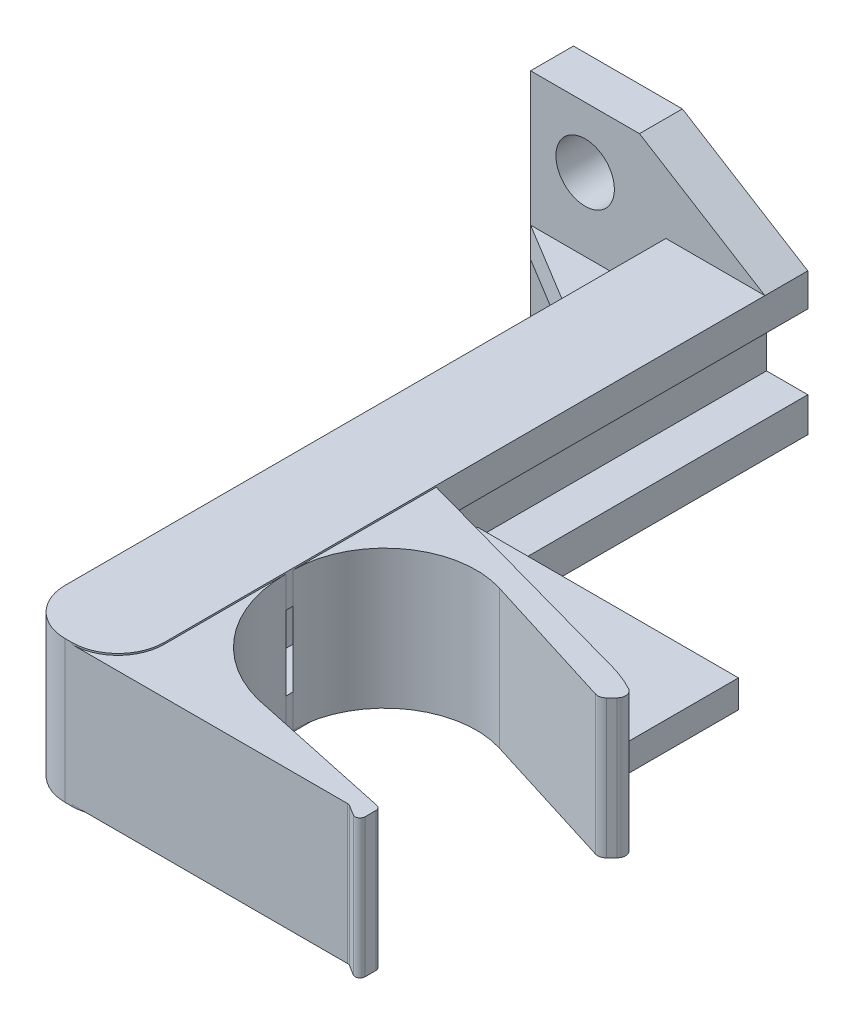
ISO-10303-21;
HEADER;
FILE_DESCRIPTION(('STEP AP214'),'2;1');
FILE_NAME('part.step','',(''),(''),'','','');
FILE_SCHEMA(('AUTOMOTIVE_DESIGN { 1 0 10303 214 1 1 1 1 }'));
ENDSEC;
DATA;
#1=APPLICATION_CONTEXT('core data for automotive mechanical design processes');
#2=APPLICATION_PROTOCOL_DEFINITION('international standard','automotive_design',2000,#1);
#3=PRODUCT_CONTEXT('',#1,'mechanical');
#4=PRODUCT('Part','Part','',(#3));
#5=PRODUCT_RELATED_PRODUCT_CATEGORY('part','',(#4));
#6=PRODUCT_DEFINITION_FORMATION('','',#4);
#7=PRODUCT_DEFINITION_CONTEXT('part definition',#1,'design');
#8=PRODUCT_DEFINITION('design','',#6,#7);
#9=PRODUCT_DEFINITION_SHAPE('','',#8);
#10=(LENGTH_UNIT() NAMED_UNIT(*) SI_UNIT(.MILLI.,.METRE.));
#11=(NAMED_UNIT(*) PLANE_ANGLE_UNIT() SI_UNIT($,.RADIAN.));
#12=(NAMED_UNIT(*) SI_UNIT($,.STERADIAN.) SOLID_ANGLE_UNIT());
#13=UNCERTAINTY_MEASURE_WITH_UNIT(LENGTH_MEASURE(1.E-05),#10,'distance_accuracy_value','');
#14=(GEOMETRIC_REPRESENTATION_CONTEXT(3) GLOBAL_UNCERTAINTY_ASSIGNED_CONTEXT((#13)) GLOBAL_UNIT_ASSIGNED_CONTEXT((#10,
#11,#12)) REPRESENTATION_CONTEXT('',''));
#15=CARTESIAN_POINT('',(0.,0.,0.));
#16=DIRECTION('',(0.,0.,1.));
#17=DIRECTION('',(1.,0.,0.));
#18=AXIS2_PLACEMENT_3D('',#15,#16,#17);
#19=CARTESIAN_POINT('',(0.,-11.43,3.302));
#20=DIRECTION('',(0.,1.,0.));
#21=DIRECTION('',(1.,0.,0.));
#22=AXIS2_PLACEMENT_3D('',#19,#20,#21);
#23=PLANE('',#22);
#24=DIRECTION('',(1.,0.,0.));
#25=VECTOR('',#24,1.);
#26=CARTESIAN_POINT('',(0.,-11.43,-22.098));
#27=LINE('',#26,#25);
#28=CARTESIAN_POINT('',(0.,-11.43,-22.098));
#29=VERTEX_POINT('',#28);
#30=CARTESIAN_POINT('',(8.382,-11.43,-22.098));
#31=VERTEX_POINT('',#30);
#32=EDGE_CURVE('E721',#29,#31,#27,.T.);
#33=ORIENTED_EDGE('',*,*,#32,.F.);
#34=DIRECTION('',(0.,0.,-1.));
#35=VECTOR('',#34,1.);
#36=CARTESIAN_POINT('',(0.,-11.43,3.302));
#37=LINE('',#36,#35);
#38=CARTESIAN_POINT('',(0.,-11.43,-25.4));
#39=VERTEX_POINT('',#38);
#40=EDGE_CURVE('E473',#29,#39,#37,.T.);
#41=ORIENTED_EDGE('',*,*,#40,.T.);
#42=DIRECTION('',(-1.,0.,0.));
#43=VECTOR('',#42,1.);
#44=CARTESIAN_POINT('',(8.382,-11.43,-25.4));
#45=LINE('',#44,#43);
#46=CARTESIAN_POINT('',(8.382,-11.43,-25.4));
#47=VERTEX_POINT('',#46);
#48=EDGE_CURVE('E580',#47,#39,#45,.T.);
#49=ORIENTED_EDGE('',*,*,#48,.F.);
#50=DIRECTION('',(0.,0.,-1.));
#51=VECTOR('',#50,1.);
#52=CARTESIAN_POINT('',(8.382,-11.43,3.302));
#53=LINE('',#52,#51);
#54=EDGE_CURVE('E420',#31,#47,#53,.T.);
#55=ORIENTED_EDGE('',*,*,#54,.F.);
#56=EDGE_LOOP('',(#33,#41,#49,#55));
#57=FACE_BOUND('',#56,.T.);
#58=ADVANCED_FACE('F38',(#57),#23,.F.);
#59=CARTESIAN_POINT('',(8.382,-11.43,3.302));
#60=DIRECTION('',(-0.525969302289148,0.850503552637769,0.));
#61=DIRECTION('',(0.,0.,1.));
#62=AXIS2_PLACEMENT_3D('',#59,#60,#61);
#63=PLANE('',#62);
#64=DIRECTION('',(0.85050355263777,0.525969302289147,0.));
#65=VECTOR('',#64,1.);
#66=CARTESIAN_POINT('',(8.382,-11.43,-22.098));
#67=LINE('',#66,#65);
#68=CARTESIAN_POINT('',(18.034,-5.461,-22.098));
#69=VERTEX_POINT('',#68);
#70=EDGE_CURVE('E715',#31,#69,#67,.T.);
#71=ORIENTED_EDGE('',*,*,#70,.F.);
#72=ORIENTED_EDGE('',*,*,#54,.T.);
#73=DIRECTION('',(-0.85050355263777,-0.525969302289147,0.));
#74=VECTOR('',#73,1.);
#75=CARTESIAN_POINT('',(18.034,-5.461,-25.4));
#76=LINE('',#75,#74);
#77=CARTESIAN_POINT('',(18.034,-5.461,-25.4));
#78=VERTEX_POINT('',#77);
#79=EDGE_CURVE('E572',#78,#47,#76,.T.);
#80=ORIENTED_EDGE('',*,*,#79,.F.);
#81=DIRECTION('',(0.,0.,-1.));
#82=VECTOR('',#81,1.);
#83=CARTESIAN_POINT('',(18.034,-5.461,3.302));
#84=LINE('',#83,#82);
#85=EDGE_CURVE('E280',#69,#78,#84,.T.);
#86=ORIENTED_EDGE('',*,*,#85,.F.);
#87=EDGE_LOOP('',(#71,#72,#80,#86));
#88=FACE_BOUND('',#87,.T.);
#89=ADVANCED_FACE('F790',(#88),#63,.F.);
#90=CARTESIAN_POINT('',(18.034,5.461,3.302));
#91=DIRECTION('',(-0.525969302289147,-0.85050355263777,0.));
#92=DIRECTION('',(-0.85050355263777,0.525969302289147,0.));
#93=AXIS2_PLACEMENT_3D('',#90,#91,#92);
#94=PLANE('',#93);
#95=DIRECTION('',(-0.85050355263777,0.525969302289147,0.));
#96=VECTOR('',#95,1.);
#97=CARTESIAN_POINT('',(18.034,5.461,-22.098));
#98=LINE('',#97,#96);
#99=CARTESIAN_POINT('',(18.034,5.461,-22.098));
#100=VERTEX_POINT('',#99);
#101=CARTESIAN_POINT('',(8.382,11.43,-22.098));
#102=VERTEX_POINT('',#101);
#103=EDGE_CURVE('E727',#100,#102,#98,.T.);
#104=ORIENTED_EDGE('',*,*,#103,.F.);
#105=DIRECTION('',(0.,0.,-1.));
#106=VECTOR('',#105,1.);
#107=CARTESIAN_POINT('',(18.034,5.461,3.302));
#108=LINE('',#107,#106);
#109=CARTESIAN_POINT('',(18.034,5.461,-25.4));
#110=VERTEX_POINT('',#109);
#111=EDGE_CURVE('E405',#100,#110,#108,.T.);
#112=ORIENTED_EDGE('',*,*,#111,.T.);
#113=DIRECTION('',(0.85050355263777,-0.525969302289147,0.));
#114=VECTOR('',#113,1.);
#115=CARTESIAN_POINT('',(8.382,11.43,-25.4));
#116=LINE('',#115,#114);
#117=CARTESIAN_POINT('',(8.382,11.43,-25.4));
#118=VERTEX_POINT('',#117);
#119=EDGE_CURVE('E436',#118,#110,#116,.T.);
#120=ORIENTED_EDGE('',*,*,#119,.F.);
#121=DIRECTION('',(0.,0.,-1.));
#122=VECTOR('',#121,1.);
#123=CARTESIAN_POINT('',(8.382,11.43,3.302));
#124=LINE('',#123,#122);
#125=EDGE_CURVE('E312',#102,#118,#124,.T.);
#126=ORIENTED_EDGE('',*,*,#125,.F.);
#127=EDGE_LOOP('',(#104,#112,#120,#126));
#128=FACE_BOUND('',#127,.T.);
#129=ADVANCED_FACE('F796',(#128),#94,.F.);
#130=CARTESIAN_POINT('',(8.382,11.43,3.302));
#131=DIRECTION('',(0.,-1.,0.));
#132=DIRECTION('',(0.,0.,-1.));
#133=AXIS2_PLACEMENT_3D('',#130,#131,#132);
#134=PLANE('',#133);
#135=DIRECTION('',(-1.,0.,0.));
#136=VECTOR('',#135,1.);
#137=CARTESIAN_POINT('',(8.382,11.43,-22.098));
#138=LINE('',#137,#136);
#139=CARTESIAN_POINT('',(0.,11.43,-22.098));
#140=VERTEX_POINT('',#139);
#141=EDGE_CURVE('E716',#102,#140,#138,.T.);
#142=ORIENTED_EDGE('',*,*,#141,.F.);
#143=ORIENTED_EDGE('',*,*,#125,.T.);
#144=DIRECTION('',(1.,0.,0.));
#145=VECTOR('',#144,1.);
#146=CARTESIAN_POINT('',(0.,11.43,-25.4));
#147=LINE('',#146,#145);
#148=CARTESIAN_POINT('',(0.,11.43,-25.4));
#149=VERTEX_POINT('',#148);
#150=EDGE_CURVE('E586',#149,#118,#147,.T.);
#151=ORIENTED_EDGE('',*,*,#150,.F.);
#152=DIRECTION('',(0.,0.,-1.));
#153=VECTOR('',#152,1.);
#154=CARTESIAN_POINT('',(0.,11.43,3.302));
#155=LINE('',#154,#153);
#156=EDGE_CURVE('E476',#140,#149,#155,.T.);
#157=ORIENTED_EDGE('',*,*,#156,.F.);
#158=EDGE_LOOP('',(#142,#143,#151,#157));
#159=FACE_BOUND('',#158,.T.);
#160=ADVANCED_FACE('F823',(#159),#134,.F.);
#161=CARTESIAN_POINT('',(18.034,-5.334,3.19227651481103));
#162=DIRECTION('',(-0.266853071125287,0.,0.963737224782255));
#163=DIRECTION('',(0.,1.,0.));
#164=AXIS2_PLACEMENT_3D('',#161,#162,#163);
#165=PLANE('',#164);
#166=DIRECTION('',(-0.963737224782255,0.,-0.266853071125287));
#167=VECTOR('',#166,1.);
#168=CARTESIAN_POINT('',(18.034,-1.0668,3.19227651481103));
#169=LINE('',#168,#167);
#170=CARTESIAN_POINT('',(36.7532655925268,-1.0668,8.37552915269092));
#171=VERTEX_POINT('',#170);
#172=CARTESIAN_POINT('',(18.034,-1.0668,3.19227651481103));
#173=VERTEX_POINT('',#172);
#174=EDGE_CURVE('E64',#171,#173,#169,.T.);
#175=ORIENTED_EDGE('',*,*,#174,.F.);
#176=DIRECTION('',(0.,1.,0.));
#177=VECTOR('',#176,1.);
#178=CARTESIAN_POINT('',(36.7532655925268,-5.334,8.37552915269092));
#179=LINE('',#178,#177);
#180=CARTESIAN_POINT('',(36.7532655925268,-5.334,8.37552915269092));
#181=VERTEX_POINT('',#180);
#182=EDGE_CURVE('E371',#181,#171,#179,.T.);
#183=ORIENTED_EDGE('',*,*,#182,.F.);
#184=DIRECTION('',(0.963737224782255,0.,0.266853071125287));
#185=VECTOR('',#184,1.);
#186=CARTESIAN_POINT('',(18.034,-5.334,3.19227651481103));
#187=LINE('',#186,#185);
#188=CARTESIAN_POINT('',(18.034,-5.334,3.19227651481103));
#189=VERTEX_POINT('',#188);
#190=EDGE_CURVE('E367',#189,#181,#187,.T.);
#191=ORIENTED_EDGE('',*,*,#190,.F.);
#192=DIRECTION('',(0.,1.,0.));
#193=VECTOR('',#192,1.);
#194=CARTESIAN_POINT('',(18.034,-5.334,3.19227651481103));
#195=LINE('',#194,#193);
#196=CARTESIAN_POINT('',(18.034,-2.794,3.19227651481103));
#197=VERTEX_POINT('',#196);
#198=EDGE_CURVE('E11',#189,#197,#195,.T.);
#199=ORIENTED_EDGE('',*,*,#198,.T.);
#200=DIRECTION('',(0.,1.,0.));
#201=VECTOR('',#200,1.);
#202=CARTESIAN_POINT('',(18.034,-5.334,3.19227651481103));
#203=LINE('',#202,#201);
#204=EDGE_CURVE('E47',#197,#173,#203,.T.);
#205=ORIENTED_EDGE('',*,*,#204,.T.);
#206=EDGE_LOOP('',(#175,#183,#191,#199,#205));
#207=FACE_BOUND('',#206,.T.);
#208=ADVANCED_FACE('F812',(#207),#165,.F.);
#209=CARTESIAN_POINT('',(34.010431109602,-5.334,18.2812487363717));
#210=DIRECTION('',(0.,1.,0.));
#211=DIRECTION('',(0.,0.,1.));
#212=AXIS2_PLACEMENT_3D('',#209,#210,#211);
#213=CYLINDRICAL_SURFACE('',#212,10.2784445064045);
#214=CARTESIAN_POINT('',(34.010431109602,-1.0668,18.2812487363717));
#215=DIRECTION('',(0.,1.,0.));
#216=DIRECTION('',(0.,0.,1.));
#217=AXIS2_PLACEMENT_3D('',#214,#215,#216);
#218=CIRCLE('',#217,10.2784445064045);
#219=CARTESIAN_POINT('',(38.1,-1.0668,8.85141057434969));
#220=VERTEX_POINT('',#219);
#221=EDGE_CURVE('E263',#220,#171,#218,.T.);
#222=ORIENTED_EDGE('',*,*,#221,.F.);
#223=DIRECTION('',(0.,1.,0.));
#224=VECTOR('',#223,1.);
#225=CARTESIAN_POINT('',(38.1,-5.334,8.85141057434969));
#226=LINE('',#225,#224);
#227=CARTESIAN_POINT('',(38.1,1.0668,8.85141057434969));
#228=VERTEX_POINT('',#227);
#229=EDGE_CURVE('E342',#220,#228,#226,.T.);
#230=ORIENTED_EDGE('',*,*,#229,.T.);
#231=CARTESIAN_POINT('',(34.010431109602,1.0668,18.2812487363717));
#232=DIRECTION('',(0.,1.,0.));
#233=DIRECTION('',(0.,0.,1.));
#234=AXIS2_PLACEMENT_3D('',#231,#232,#233);
#235=CIRCLE('',#234,10.2784445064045);
#236=CARTESIAN_POINT('',(36.7532655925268,1.0668,8.37552915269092));
#237=VERTEX_POINT('',#236);
#238=EDGE_CURVE('E344',#228,#237,#235,.T.);
#239=ORIENTED_EDGE('',*,*,#238,.T.);
#240=DIRECTION('',(0.,1.,0.));
#241=VECTOR('',#240,1.);
#242=CARTESIAN_POINT('',(36.7532655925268,-5.334,8.37552915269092));
#243=LINE('',#242,#241);
#244=CARTESIAN_POINT('',(36.7532655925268,5.334,8.37552915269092));
#245=VERTEX_POINT('',#244);
#246=EDGE_CURVE('E380',#237,#245,#243,.T.);
#247=ORIENTED_EDGE('',*,*,#246,.T.);
#248=CARTESIAN_POINT('',(34.010431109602,5.334,18.2812487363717));
#249=DIRECTION('',(0.,-1.,0.));
#250=DIRECTION('',(1.,0.,0.));
#251=AXIS2_PLACEMENT_3D('',#248,#249,#250);
#252=CIRCLE('',#251,10.2784445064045);
#253=CARTESIAN_POINT('',(38.8675233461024,5.334,9.22282301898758));
#254=VERTEX_POINT('',#253);
#255=EDGE_CURVE('E383',#245,#254,#252,.T.);
#256=ORIENTED_EDGE('',*,*,#255,.T.);
#257=DIRECTION('',(0.,-1.,0.));
#258=VECTOR('',#257,1.);
#259=CARTESIAN_POINT('',(38.8675233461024,-5.334,9.22282301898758));
#260=LINE('',#259,#258);
#261=CARTESIAN_POINT('',(38.8675233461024,-5.334,9.22282301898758));
#262=VERTEX_POINT('',#261);
#263=EDGE_CURVE('E416',#254,#262,#260,.T.);
#264=ORIENTED_EDGE('',*,*,#263,.T.);
#265=CARTESIAN_POINT('',(34.010431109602,-5.334,18.2812487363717));
#266=DIRECTION('',(0.,-1.,0.));
#267=DIRECTION('',(1.,0.,0.));
#268=AXIS2_PLACEMENT_3D('',#265,#266,#267);
#269=CIRCLE('',#268,10.2784445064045);
#270=EDGE_CURVE('E242',#181,#262,#269,.T.);
#271=ORIENTED_EDGE('',*,*,#270,.F.);
#272=ORIENTED_EDGE('',*,*,#182,.T.);
#273=EDGE_LOOP('',(#222,#230,#239,#247,#256,#264,#271,#272));
#274=FACE_BOUND('',#273,.T.);
#275=ADVANCED_FACE('F595',(#274),#213,.T.);
#276=CARTESIAN_POINT('',(18.034,-5.461,3.302));
#277=DIRECTION('',(-1.,0.,0.));
#278=DIRECTION('',(0.,0.,1.));
#279=AXIS2_PLACEMENT_3D('',#276,#277,#278);
#280=PLANE('',#279);
#281=DIRECTION('',(0.,1.,0.));
#282=VECTOR('',#281,1.);
#283=CARTESIAN_POINT('',(18.034,-5.334,14.7701913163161));
#284=LINE('',#283,#282);
#285=CARTESIAN_POINT('',(18.034,-5.334,14.7701913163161));
#286=VERTEX_POINT('',#285);
#287=CARTESIAN_POINT('',(18.034,-2.794,14.7701913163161));
#288=VERTEX_POINT('',#287);
#289=EDGE_CURVE('E275',#286,#288,#284,.T.);
#290=ORIENTED_EDGE('',*,*,#289,.F.);
#291=DIRECTION('',(0.,0.,-1.));
#292=VECTOR('',#291,1.);
#293=CARTESIAN_POINT('',(18.034,-5.334,24.13));
#294=LINE('',#293,#292);
#295=CARTESIAN_POINT('',(18.034,-5.334,24.13));
#296=VERTEX_POINT('',#295);
#297=EDGE_CURVE('E465',#296,#286,#294,.T.);
#298=ORIENTED_EDGE('',*,*,#297,.F.);
#299=DIRECTION('',(0.,-1.,0.));
#300=VECTOR('',#299,1.);
#301=CARTESIAN_POINT('',(18.034,-5.461,24.13));
#302=LINE('',#301,#300);
#303=CARTESIAN_POINT('',(18.034,-5.461,24.13));
#304=VERTEX_POINT('',#303);
#305=EDGE_CURVE('E279',#296,#304,#302,.T.);
#306=ORIENTED_EDGE('',*,*,#305,.T.);
#307=DIRECTION('',(0.,0.,-1.));
#308=VECTOR('',#307,1.);
#309=CARTESIAN_POINT('',(18.034,-5.461,27.686));
#310=LINE('',#309,#308);
#311=EDGE_CURVE('E277',#304,#69,#310,.T.);
#312=ORIENTED_EDGE('',*,*,#311,.T.);
#313=ORIENTED_EDGE('',*,*,#85,.T.);
#314=DIRECTION('',(0.,-1.,0.));
#315=VECTOR('',#314,1.);
#316=CARTESIAN_POINT('',(18.034,-2.794,-25.4));
#317=LINE('',#316,#315);
#318=CARTESIAN_POINT('',(18.034,-2.794,-25.4));
#319=VERTEX_POINT('',#318);
#320=EDGE_CURVE('E569',#319,#78,#317,.T.);
#321=ORIENTED_EDGE('',*,*,#320,.F.);
#322=DIRECTION('',(0.,0.,-1.));
#323=VECTOR('',#322,1.);
#324=CARTESIAN_POINT('',(18.034,-2.794,20.32));
#325=LINE('',#324,#323);
#326=EDGE_CURVE('E446',#197,#319,#325,.T.);
#327=ORIENTED_EDGE('',*,*,#326,.F.);
#328=ORIENTED_EDGE('',*,*,#198,.F.);
#329=DIRECTION('',(0.,0.,-1.));
#330=VECTOR('',#329,1.);
#331=CARTESIAN_POINT('',(18.034,-5.334,14.224));
#332=LINE('',#331,#330);
#333=CARTESIAN_POINT('',(18.034,-5.334,14.224));
#334=VERTEX_POINT('',#333);
#335=EDGE_CURVE('E457',#334,#189,#332,.T.);
#336=ORIENTED_EDGE('',*,*,#335,.F.);
#337=DIRECTION('',(0.,1.,0.));
#338=VECTOR('',#337,1.);
#339=CARTESIAN_POINT('',(18.034,-5.334,14.224));
#340=LINE('',#339,#338);
#341=CARTESIAN_POINT('',(18.034,-2.794,14.224));
#342=VERTEX_POINT('',#341);
#343=EDGE_CURVE('E535',#334,#342,#340,.T.);
#344=ORIENTED_EDGE('',*,*,#343,.T.);
#345=DIRECTION('',(0.,0.,-1.));
#346=VECTOR('',#345,1.);
#347=CARTESIAN_POINT('',(18.034,-2.794,20.32));
#348=LINE('',#347,#346);
#349=EDGE_CURVE('E320',#288,#342,#348,.T.);
#350=ORIENTED_EDGE('',*,*,#349,.F.);
#351=EDGE_LOOP('',(#290,#298,#306,#312,#313,#321,#327,#328,#336,#344,#350));
#352=FACE_BOUND('',#351,.T.);
#353=ADVANCED_FACE('F667',(#352),#280,.F.);
#354=CARTESIAN_POINT('',(18.034,-5.461,3.302));
#355=DIRECTION('',(-1.,0.,0.));
#356=DIRECTION('',(0.,0.,1.));
#357=AXIS2_PLACEMENT_3D('',#354,#355,#356);
#358=PLANE('',#357);
#359=DIRECTION('',(0.,1.,0.));
#360=VECTOR('',#359,1.);
#361=CARTESIAN_POINT('',(18.034,-5.334,14.7701913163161));
#362=LINE('',#361,#360);
#363=CARTESIAN_POINT('',(18.034,2.921,14.7701913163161));
#364=VERTEX_POINT('',#363);
#365=CARTESIAN_POINT('',(18.034,5.334,14.7701913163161));
#366=VERTEX_POINT('',#365);
#367=EDGE_CURVE('E276',#364,#366,#362,.T.);
#368=ORIENTED_EDGE('',*,*,#367,.F.);
#369=DIRECTION('',(0.,0.,-1.));
#370=VECTOR('',#369,1.);
#371=CARTESIAN_POINT('',(18.034,2.921,20.32));
#372=LINE('',#371,#370);
#373=CARTESIAN_POINT('',(18.034,2.921,14.224));
#374=VERTEX_POINT('',#373);
#375=EDGE_CURVE('E315',#364,#374,#372,.T.);
#376=ORIENTED_EDGE('',*,*,#375,.T.);
#377=DIRECTION('',(0.,1.,0.));
#378=VECTOR('',#377,1.);
#379=CARTESIAN_POINT('',(18.034,-5.334,14.224));
#380=LINE('',#379,#378);
#381=CARTESIAN_POINT('',(18.034,5.334,14.224));
#382=VERTEX_POINT('',#381);
#383=EDGE_CURVE('E313',#374,#382,#380,.T.);
#384=ORIENTED_EDGE('',*,*,#383,.T.);
#385=DIRECTION('',(0.,0.,-1.));
#386=VECTOR('',#385,1.);
#387=CARTESIAN_POINT('',(18.034,5.334,14.224));
#388=LINE('',#387,#386);
#389=CARTESIAN_POINT('',(18.034,5.334,3.19227651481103));
#390=VERTEX_POINT('',#389);
#391=EDGE_CURVE('E256',#382,#390,#388,.T.);
#392=ORIENTED_EDGE('',*,*,#391,.T.);
#393=DIRECTION('',(0.,1.,0.));
#394=VECTOR('',#393,1.);
#395=CARTESIAN_POINT('',(18.034,-5.334,3.19227651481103));
#396=LINE('',#395,#394);
#397=CARTESIAN_POINT('',(18.034,2.921,3.19227651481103));
#398=VERTEX_POINT('',#397);
#399=EDGE_CURVE('E393',#398,#390,#396,.T.);
#400=ORIENTED_EDGE('',*,*,#399,.F.);
#401=DIRECTION('',(0.,0.,-1.));
#402=VECTOR('',#401,1.);
#403=CARTESIAN_POINT('',(18.034,2.921,20.32));
#404=LINE('',#403,#402);
#405=CARTESIAN_POINT('',(18.034,2.921,-25.4));
#406=VERTEX_POINT('',#405);
#407=EDGE_CURVE('E500',#398,#406,#404,.T.);
#408=ORIENTED_EDGE('',*,*,#407,.T.);
#409=DIRECTION('',(0.,-1.,0.));
#410=VECTOR('',#409,1.);
#411=CARTESIAN_POINT('',(18.034,5.461,-25.4));
#412=LINE('',#411,#410);
#413=EDGE_CURVE('E725',#110,#406,#412,.T.);
#414=ORIENTED_EDGE('',*,*,#413,.F.);
#415=ORIENTED_EDGE('',*,*,#111,.F.);
#416=CARTESIAN_POINT('',(18.034,5.461,24.13));
#417=VERTEX_POINT('',#416);
#418=EDGE_CURVE('E417',#417,#100,#108,.T.);
#419=ORIENTED_EDGE('',*,*,#418,.F.);
#420=DIRECTION('',(0.,-1.,0.));
#421=VECTOR('',#420,1.);
#422=CARTESIAN_POINT('',(18.034,-5.461,24.13));
#423=LINE('',#422,#421);
#424=CARTESIAN_POINT('',(18.034,5.334,24.13));
#425=VERTEX_POINT('',#424);
#426=EDGE_CURVE('E503',#417,#425,#423,.T.);
#427=ORIENTED_EDGE('',*,*,#426,.T.);
#428=DIRECTION('',(0.,0.,-1.));
#429=VECTOR('',#428,1.);
#430=CARTESIAN_POINT('',(18.034,5.334,24.13));
#431=LINE('',#430,#429);
#432=EDGE_CURVE('E504',#425,#366,#431,.T.);
#433=ORIENTED_EDGE('',*,*,#432,.T.);
#434=EDGE_LOOP('',(#368,#376,#384,#392,#400,#408,#414,#415,#419,#427,#433));
#435=FACE_BOUND('',#434,.T.);
#436=ADVANCED_FACE('F683',(#435),#358,.F.);
#437=CARTESIAN_POINT('',(14.478,0.,24.13));
#438=DIRECTION('',(0.,-1.,0.));
#439=DIRECTION('',(0.,0.,-1.));
#440=AXIS2_PLACEMENT_3D('',#437,#438,#439);
#441=CYLINDRICAL_SURFACE('',#440,3.556);
#442=ORIENTED_EDGE('',*,*,#305,.F.);
#443=CARTESIAN_POINT('',(14.478,-5.334,24.13));
#444=DIRECTION('',(0.,1.,0.));
#445=DIRECTION('',(-1.,0.,0.));
#446=AXIS2_PLACEMENT_3D('',#443,#444,#445);
#447=CIRCLE('',#446,3.556);
#448=CARTESIAN_POINT('',(14.478,-5.334,27.686));
#449=VERTEX_POINT('',#448);
#450=EDGE_CURVE('E455',#449,#296,#447,.T.);
#451=ORIENTED_EDGE('',*,*,#450,.F.);
#452=DIRECTION('',(0.,1.,0.));
#453=VECTOR('',#452,1.);
#454=CARTESIAN_POINT('',(14.478,5.461,27.686));
#455=LINE('',#454,#453);
#456=CARTESIAN_POINT('',(14.478,-5.461,27.686));
#457=VERTEX_POINT('',#456);
#458=EDGE_CURVE('E285',#457,#449,#455,.T.);
#459=ORIENTED_EDGE('',*,*,#458,.F.);
#460=CARTESIAN_POINT('',(14.478,-5.461,24.13));
#461=DIRECTION('',(0.,-1.,0.));
#462=DIRECTION('',(-1.,0.,0.));
#463=AXIS2_PLACEMENT_3D('',#460,#461,#462);
#464=CIRCLE('',#463,3.556);
#465=EDGE_CURVE('E413',#304,#457,#464,.T.);
#466=ORIENTED_EDGE('',*,*,#465,.F.);
#467=EDGE_LOOP('',(#442,#451,#459,#466));
#468=FACE_BOUND('',#467,.T.);
#469=ADVANCED_FACE('F655',(#468),#441,.T.);
#470=CARTESIAN_POINT('',(0.,11.43,3.302));
#471=DIRECTION('',(1.,0.,0.));
#472=DIRECTION('',(0.,1.,0.));
#473=AXIS2_PLACEMENT_3D('',#470,#471,#472);
#474=PLANE('',#473);
#475=DIRECTION('',(0.,-1.,0.));
#476=VECTOR('',#475,1.);
#477=CARTESIAN_POINT('',(0.,-1.143,-22.098));
#478=LINE('',#477,#476);
#479=CARTESIAN_POINT('',(0.,-1.143,-22.098));
#480=VERTEX_POINT('',#479);
#481=EDGE_CURVE('E1201',#480,#29,#478,.T.);
#482=ORIENTED_EDGE('',*,*,#481,.F.);
#483=DIRECTION('',(0.,-1.,0.));
#484=VECTOR('',#483,1.);
#485=CARTESIAN_POINT('',(0.,24.257,-22.098));
#486=LINE('',#485,#484);
#487=CARTESIAN_POINT('',(0.,1.143,-22.098));
#488=VERTEX_POINT('',#487);
#489=EDGE_CURVE('E1231',#488,#480,#486,.T.);
#490=ORIENTED_EDGE('',*,*,#489,.F.);
#491=DIRECTION('',(0.,-1.,0.));
#492=VECTOR('',#491,1.);
#493=CARTESIAN_POINT('',(0.,11.43,-22.098));
#494=LINE('',#493,#492);
#495=EDGE_CURVE('E719',#140,#488,#494,.T.);
#496=ORIENTED_EDGE('',*,*,#495,.F.);
#497=ORIENTED_EDGE('',*,*,#156,.T.);
#498=DIRECTION('',(0.,1.,0.));
#499=VECTOR('',#498,1.);
#500=CARTESIAN_POINT('',(0.,-11.43,-25.4));
#501=LINE('',#500,#499);
#502=EDGE_CURVE('E583',#39,#149,#501,.T.);
#503=ORIENTED_EDGE('',*,*,#502,.F.);
#504=ORIENTED_EDGE('',*,*,#40,.F.);
#505=EDGE_LOOP('',(#482,#490,#496,#497,#503,#504));
#506=FACE_BOUND('',#505,.T.);
#507=ADVANCED_FACE('F983',(#506),#474,.F.);
#508=CARTESIAN_POINT('',(10.414,5.461,27.686));
#509=DIRECTION('',(1.,0.,0.));
#510=DIRECTION('',(0.,0.,1.));
#511=AXIS2_PLACEMENT_3D('',#508,#509,#510);
#512=PLANE('',#511);
#513=DIRECTION('',(0.,0.,-1.));
#514=VECTOR('',#513,1.);
#515=CARTESIAN_POINT('',(10.414,5.461,27.686));
#516=LINE('',#515,#514);
#517=CARTESIAN_POINT('',(10.414,5.461,24.13));
#518=VERTEX_POINT('',#517);
#519=CARTESIAN_POINT('',(10.414,5.461,-22.098));
#520=VERTEX_POINT('',#519);
#521=EDGE_CURVE('E287',#518,#520,#516,.T.);
#522=ORIENTED_EDGE('',*,*,#521,.T.);
#523=DIRECTION('',(0.,1.,0.));
#524=VECTOR('',#523,1.);
#525=CARTESIAN_POINT('',(10.414,1.143,-22.098));
#526=LINE('',#525,#524);
#527=CARTESIAN_POINT('',(10.414,1.143,-22.098));
#528=VERTEX_POINT('',#527);
#529=EDGE_CURVE('E1196',#528,#520,#526,.T.);
#530=ORIENTED_EDGE('',*,*,#529,.F.);
#531=DIRECTION('',(0.,0.,1.));
#532=VECTOR('',#531,1.);
#533=CARTESIAN_POINT('',(10.414,1.143,3.302));
#534=LINE('',#533,#532);
#535=CARTESIAN_POINT('',(10.414,1.143,-15.7908554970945));
#536=VERTEX_POINT('',#535);
#537=EDGE_CURVE('E309',#528,#536,#534,.T.);
#538=ORIENTED_EDGE('',*,*,#537,.T.);
#539=DIRECTION('',(0.,-1.,0.));
#540=VECTOR('',#539,1.);
#541=CARTESIAN_POINT('',(10.414,24.257,-15.7908554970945));
#542=LINE('',#541,#540);
#543=CARTESIAN_POINT('',(10.414,-1.143,-15.7908554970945));
#544=VERTEX_POINT('',#543);
#545=EDGE_CURVE('E55',#536,#544,#542,.T.);
#546=ORIENTED_EDGE('',*,*,#545,.T.);
#547=DIRECTION('',(0.,0.,1.));
#548=VECTOR('',#547,1.);
#549=CARTESIAN_POINT('',(10.414,-1.143,3.302));
#550=LINE('',#549,#548);
#551=CARTESIAN_POINT('',(10.414,-1.143,-22.098));
#552=VERTEX_POINT('',#551);
#553=EDGE_CURVE('E303',#552,#544,#550,.T.);
#554=ORIENTED_EDGE('',*,*,#553,.F.);
#555=DIRECTION('',(0.,1.,0.));
#556=VECTOR('',#555,1.);
#557=CARTESIAN_POINT('',(10.414,-5.461,-22.098));
#558=LINE('',#557,#556);
#559=CARTESIAN_POINT('',(10.414,-5.461,-22.098));
#560=VERTEX_POINT('',#559);
#561=EDGE_CURVE('E703',#560,#552,#558,.T.);
#562=ORIENTED_EDGE('',*,*,#561,.F.);
#563=DIRECTION('',(0.,0.,-1.));
#564=VECTOR('',#563,1.);
#565=CARTESIAN_POINT('',(10.414,-5.461,27.686));
#566=LINE('',#565,#564);
#567=CARTESIAN_POINT('',(10.414,-5.461,24.13));
#568=VERTEX_POINT('',#567);
#569=EDGE_CURVE('E437',#568,#560,#566,.T.);
#570=ORIENTED_EDGE('',*,*,#569,.F.);
#571=DIRECTION('',(0.,1.,0.));
#572=VECTOR('',#571,1.);
#573=CARTESIAN_POINT('',(10.414,5.461,24.13));
#574=LINE('',#573,#572);
#575=EDGE_CURVE('E290',#568,#518,#574,.T.);
#576=ORIENTED_EDGE('',*,*,#575,.T.);
#577=EDGE_LOOP('',(#522,#530,#538,#546,#554,#562,#570,#576));
#578=FACE_BOUND('',#577,.T.);
#579=ADVANCED_FACE('F704',(#578),#512,.F.);
#580=CARTESIAN_POINT('',(10.414,-5.461,27.686));
#581=DIRECTION('',(0.,1.,0.));
#582=DIRECTION('',(1.,0.,0.));
#583=AXIS2_PLACEMENT_3D('',#580,#581,#582);
#584=PLANE('',#583);
#585=DIRECTION('',(1.,0.,0.));
#586=VECTOR('',#585,1.);
#587=CARTESIAN_POINT('',(10.414,-5.461,27.686));
#588=LINE('',#587,#586);
#589=CARTESIAN_POINT('',(13.97,-5.461,27.686));
#590=VERTEX_POINT('',#589);
#591=EDGE_CURVE('E292',#590,#457,#588,.T.);
#592=ORIENTED_EDGE('',*,*,#591,.F.);
#593=CARTESIAN_POINT('',(13.97,-5.461,24.13));
#594=DIRECTION('',(0.,-1.,0.));
#595=DIRECTION('',(-1.,0.,0.));
#596=AXIS2_PLACEMENT_3D('',#593,#594,#595);
#597=CIRCLE('',#596,3.556);
#598=EDGE_CURVE('E291',#590,#568,#597,.T.);
#599=ORIENTED_EDGE('',*,*,#598,.T.);
#600=ORIENTED_EDGE('',*,*,#569,.T.);
#601=DIRECTION('',(-1.,0.,0.));
#602=VECTOR('',#601,1.);
#603=CARTESIAN_POINT('',(18.034,-5.461,-22.098));
#604=LINE('',#603,#602);
#605=EDGE_CURVE('E662',#69,#560,#604,.T.);
#606=ORIENTED_EDGE('',*,*,#605,.F.);
#607=ORIENTED_EDGE('',*,*,#311,.F.);
#608=ORIENTED_EDGE('',*,*,#465,.T.);
#609=EDGE_LOOP('',(#592,#599,#600,#606,#607,#608));
#610=FACE_BOUND('',#609,.T.);
#611=ADVANCED_FACE('F657',(#610),#584,.F.);
#612=CARTESIAN_POINT('',(18.034,5.461,27.686));
#613=DIRECTION('',(0.,-1.,0.));
#614=DIRECTION('',(-1.,0.,0.));
#615=AXIS2_PLACEMENT_3D('',#612,#613,#614);
#616=PLANE('',#615);
#617=ORIENTED_EDGE('',*,*,#521,.F.);
#618=CARTESIAN_POINT('',(13.97,5.461,24.13));
#619=DIRECTION('',(0.,1.,0.));
#620=DIRECTION('',(1.,0.,0.));
#621=AXIS2_PLACEMENT_3D('',#618,#619,#620);
#622=CIRCLE('',#621,3.556);
#623=CARTESIAN_POINT('',(13.97,5.461,27.686));
#624=VERTEX_POINT('',#623);
#625=EDGE_CURVE('E270',#518,#624,#622,.T.);
#626=ORIENTED_EDGE('',*,*,#625,.T.);
#627=DIRECTION('',(-1.,0.,0.));
#628=VECTOR('',#627,1.);
#629=CARTESIAN_POINT('',(18.034,5.461,27.686));
#630=LINE('',#629,#628);
#631=CARTESIAN_POINT('',(14.478,5.461,27.686));
#632=VERTEX_POINT('',#631);
#633=EDGE_CURVE('E379',#632,#624,#630,.T.);
#634=ORIENTED_EDGE('',*,*,#633,.F.);
#635=CARTESIAN_POINT('',(14.478,5.461,24.13));
#636=DIRECTION('',(0.,1.,0.));
#637=DIRECTION('',(1.,0.,0.));
#638=AXIS2_PLACEMENT_3D('',#635,#636,#637);
#639=CIRCLE('',#638,3.556);
#640=EDGE_CURVE('E267',#632,#417,#639,.T.);
#641=ORIENTED_EDGE('',*,*,#640,.T.);
#642=ORIENTED_EDGE('',*,*,#418,.T.);
#643=DIRECTION('',(1.,0.,0.));
#644=VECTOR('',#643,1.);
#645=CARTESIAN_POINT('',(10.414,5.461,-22.098));
#646=LINE('',#645,#644);
#647=EDGE_CURVE('E1194',#520,#100,#646,.T.);
#648=ORIENTED_EDGE('',*,*,#647,.F.);
#649=EDGE_LOOP('',(#617,#626,#634,#641,#642,#648));
#650=FACE_BOUND('',#649,.T.);
#651=ADVANCED_FACE('F691',(#650),#616,.F.);
#652=CARTESIAN_POINT('',(0.,0.,27.686));
#653=DIRECTION('',(0.,0.,1.));
#654=DIRECTION('',(1.,0.,0.));
#655=AXIS2_PLACEMENT_3D('',#652,#653,#654);
#656=PLANE('',#655);
#657=DIRECTION('',(-1.,0.,0.));
#658=VECTOR('',#657,1.);
#659=CARTESIAN_POINT('',(35.814,-5.334,27.686));
#660=LINE('',#659,#658);
#661=CARTESIAN_POINT('',(35.7053984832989,-5.334,27.686));
#662=VERTEX_POINT('',#661);
#663=EDGE_CURVE('E452',#662,#449,#660,.T.);
#664=ORIENTED_EDGE('',*,*,#663,.F.);
#665=DIRECTION('',(0.,1.,0.));
#666=VECTOR('',#665,1.);
#667=CARTESIAN_POINT('',(35.7053984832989,0.,27.686));
#668=LINE('',#667,#666);
#669=CARTESIAN_POINT('',(35.7053984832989,5.334,27.686));
#670=VERTEX_POINT('',#669);
#671=EDGE_CURVE('E271',#662,#670,#668,.T.);
#672=ORIENTED_EDGE('',*,*,#671,.T.);
#673=DIRECTION('',(-1.,0.,0.));
#674=VECTOR('',#673,1.);
#675=CARTESIAN_POINT('',(35.814,5.334,27.686));
#676=LINE('',#675,#674);
#677=CARTESIAN_POINT('',(14.478,5.334,27.686));
#678=VERTEX_POINT('',#677);
#679=EDGE_CURVE('E378',#670,#678,#676,.T.);
#680=ORIENTED_EDGE('',*,*,#679,.T.);
#681=DIRECTION('',(0.,1.,0.));
#682=VECTOR('',#681,1.);
#683=CARTESIAN_POINT('',(14.478,5.461,27.686));
#684=LINE('',#683,#682);
#685=EDGE_CURVE('E375',#678,#632,#684,.T.);
#686=ORIENTED_EDGE('',*,*,#685,.T.);
#687=ORIENTED_EDGE('',*,*,#633,.T.);
#688=DIRECTION('',(0.,-1.,0.));
#689=VECTOR('',#688,1.);
#690=CARTESIAN_POINT('',(13.97,-5.461,27.686));
#691=LINE('',#690,#689);
#692=EDGE_CURVE('E295',#624,#590,#691,.T.);
#693=ORIENTED_EDGE('',*,*,#692,.T.);
#694=ORIENTED_EDGE('',*,*,#591,.T.);
#695=ORIENTED_EDGE('',*,*,#458,.T.);
#696=EDGE_LOOP('',(#664,#672,#680,#686,#687,#693,#694,#695));
#697=FACE_BOUND('',#696,.T.);
#698=ADVANCED_FACE('F651',(#697),#656,.T.);
#699=CARTESIAN_POINT('',(13.97,0.,24.13));
#700=DIRECTION('',(0.,1.,0.));
#701=DIRECTION('',(-1.,0.,0.));
#702=AXIS2_PLACEMENT_3D('',#699,#700,#701);
#703=CYLINDRICAL_SURFACE('',#702,3.556);
#704=ORIENTED_EDGE('',*,*,#625,.F.);
#705=ORIENTED_EDGE('',*,*,#575,.F.);
#706=ORIENTED_EDGE('',*,*,#598,.F.);
#707=ORIENTED_EDGE('',*,*,#692,.F.);
#708=EDGE_LOOP('',(#704,#705,#706,#707));
#709=FACE_BOUND('',#708,.T.);
#710=ADVANCED_FACE('F695',(#709),#703,.T.);
#711=CARTESIAN_POINT('',(14.478,0.,24.13));
#712=DIRECTION('',(0.,-1.,0.));
#713=DIRECTION('',(0.,0.,-1.));
#714=AXIS2_PLACEMENT_3D('',#711,#712,#713);
#715=CYLINDRICAL_SURFACE('',#714,3.556);
#716=CARTESIAN_POINT('',(14.478,5.334,24.13));
#717=DIRECTION('',(0.,1.,0.));
#718=DIRECTION('',(-1.,0.,0.));
#719=AXIS2_PLACEMENT_3D('',#716,#717,#718);
#720=CIRCLE('',#719,3.556);
#721=EDGE_CURVE('E282',#678,#425,#720,.T.);
#722=ORIENTED_EDGE('',*,*,#721,.T.);
#723=ORIENTED_EDGE('',*,*,#426,.F.);
#724=ORIENTED_EDGE('',*,*,#640,.F.);
#725=ORIENTED_EDGE('',*,*,#685,.F.);
#726=EDGE_LOOP('',(#722,#723,#724,#725));
#727=FACE_BOUND('',#726,.T.);
#728=ADVANCED_FACE('F687',(#727),#715,.T.);
#729=CARTESIAN_POINT('',(14.859,2.921,20.32));
#730=DIRECTION('',(0.,1.,0.));
#731=DIRECTION('',(1.,0.,0.));
#732=AXIS2_PLACEMENT_3D('',#729,#730,#731);
#733=PLANE('',#732);
#734=DIRECTION('',(0.,0.,1.));
#735=VECTOR('',#734,1.);
#736=CARTESIAN_POINT('',(14.859,2.921,20.32));
#737=LINE('',#736,#735);
#738=CARTESIAN_POINT('',(14.859,2.921,-25.4));
#739=VERTEX_POINT('',#738);
#740=CARTESIAN_POINT('',(14.859,2.921,20.32));
#741=VERTEX_POINT('',#740);
#742=EDGE_CURVE('E450',#739,#741,#737,.T.);
#743=ORIENTED_EDGE('',*,*,#742,.F.);
#744=DIRECTION('',(-1.,0.,0.));
#745=VECTOR('',#744,1.);
#746=CARTESIAN_POINT('',(18.034,2.921,-25.4));
#747=LINE('',#746,#745);
#748=EDGE_CURVE('E574',#406,#739,#747,.T.);
#749=ORIENTED_EDGE('',*,*,#748,.F.);
#750=ORIENTED_EDGE('',*,*,#407,.F.);
#751=DIRECTION('',(0.,0.,-1.));
#752=VECTOR('',#751,1.);
#753=CARTESIAN_POINT('',(18.034,2.921,20.32));
#754=LINE('',#753,#752);
#755=EDGE_CURVE('E42',#374,#398,#754,.T.);
#756=ORIENTED_EDGE('',*,*,#755,.F.);
#757=ORIENTED_EDGE('',*,*,#375,.F.);
#758=DIRECTION('',(0.,0.,-1.));
#759=VECTOR('',#758,1.);
#760=CARTESIAN_POINT('',(18.034,2.921,20.32));
#761=LINE('',#760,#759);
#762=CARTESIAN_POINT('',(18.034,2.921,20.32));
#763=VERTEX_POINT('',#762);
#764=EDGE_CURVE('E324',#763,#364,#761,.T.);
#765=ORIENTED_EDGE('',*,*,#764,.F.);
#766=DIRECTION('',(-1.,0.,0.));
#767=VECTOR('',#766,1.);
#768=CARTESIAN_POINT('',(14.859,2.921,20.32));
#769=LINE('',#768,#767);
#770=EDGE_CURVE('E286',#763,#741,#769,.T.);
#771=ORIENTED_EDGE('',*,*,#770,.T.);
#772=EDGE_LOOP('',(#743,#749,#750,#756,#757,#765,#771));
#773=FACE_BOUND('',#772,.T.);
#774=ADVANCED_FACE('F736',(#773),#733,.F.);
#775=CARTESIAN_POINT('',(18.034,-2.794,20.32));
#776=DIRECTION('',(0.,-1.,0.));
#777=DIRECTION('',(0.,0.,-1.));
#778=AXIS2_PLACEMENT_3D('',#775,#776,#777);
#779=PLANE('',#778);
#780=ORIENTED_EDGE('',*,*,#326,.T.);
#781=DIRECTION('',(1.,0.,0.));
#782=VECTOR('',#781,1.);
#783=CARTESIAN_POINT('',(14.859,-2.794,-25.4));
#784=LINE('',#783,#782);
#785=CARTESIAN_POINT('',(14.859,-2.794,-25.4));
#786=VERTEX_POINT('',#785);
#787=EDGE_CURVE('E561',#786,#319,#784,.T.);
#788=ORIENTED_EDGE('',*,*,#787,.F.);
#789=DIRECTION('',(0.,0.,1.));
#790=VECTOR('',#789,1.);
#791=CARTESIAN_POINT('',(14.859,-2.794,20.32));
#792=LINE('',#791,#790);
#793=CARTESIAN_POINT('',(14.859,-2.794,20.32));
#794=VERTEX_POINT('',#793);
#795=EDGE_CURVE('E334',#786,#794,#792,.T.);
#796=ORIENTED_EDGE('',*,*,#795,.T.);
#797=DIRECTION('',(1.,0.,0.));
#798=VECTOR('',#797,1.);
#799=CARTESIAN_POINT('',(18.034,-2.794,20.32));
#800=LINE('',#799,#798);
#801=CARTESIAN_POINT('',(18.034,-2.794,20.32));
#802=VERTEX_POINT('',#801);
#803=EDGE_CURVE('E319',#794,#802,#800,.T.);
#804=ORIENTED_EDGE('',*,*,#803,.T.);
#805=DIRECTION('',(0.,0.,-1.));
#806=VECTOR('',#805,1.);
#807=CARTESIAN_POINT('',(18.034,-2.794,20.32));
#808=LINE('',#807,#806);
#809=EDGE_CURVE('E316',#802,#288,#808,.T.);
#810=ORIENTED_EDGE('',*,*,#809,.T.);
#811=ORIENTED_EDGE('',*,*,#349,.T.);
#812=DIRECTION('',(0.,0.,-1.));
#813=VECTOR('',#812,1.);
#814=CARTESIAN_POINT('',(18.034,-2.794,20.32));
#815=LINE('',#814,#813);
#816=EDGE_CURVE('E449',#342,#197,#815,.T.);
#817=ORIENTED_EDGE('',*,*,#816,.T.);
#818=EDGE_LOOP('',(#780,#788,#796,#804,#810,#811,#817));
#819=FACE_BOUND('',#818,.T.);
#820=ADVANCED_FACE('F559',(#819),#779,.F.);
#821=CARTESIAN_POINT('',(14.859,-2.794,20.32));
#822=DIRECTION('',(-1.,0.,0.));
#823=DIRECTION('',(0.,0.,1.));
#824=AXIS2_PLACEMENT_3D('',#821,#822,#823);
#825=PLANE('',#824);
#826=ORIENTED_EDGE('',*,*,#795,.F.);
#827=DIRECTION('',(0.,-1.,0.));
#828=VECTOR('',#827,1.);
#829=CARTESIAN_POINT('',(14.859,2.921,-25.4));
#830=LINE('',#829,#828);
#831=EDGE_CURVE('E570',#739,#786,#830,.T.);
#832=ORIENTED_EDGE('',*,*,#831,.F.);
#833=ORIENTED_EDGE('',*,*,#742,.T.);
#834=DIRECTION('',(0.,-1.,0.));
#835=VECTOR('',#834,1.);
#836=CARTESIAN_POINT('',(14.859,-2.794,20.32));
#837=LINE('',#836,#835);
#838=EDGE_CURVE('E299',#741,#794,#837,.T.);
#839=ORIENTED_EDGE('',*,*,#838,.T.);
#840=EDGE_LOOP('',(#826,#832,#833,#839));
#841=FACE_BOUND('',#840,.T.);
#842=ADVANCED_FACE('F548',(#841),#825,.F.);
#843=CARTESIAN_POINT('',(0.,0.,20.32));
#844=DIRECTION('',(0.,0.,-1.));
#845=DIRECTION('',(0.,-1.,0.));
#846=AXIS2_PLACEMENT_3D('',#843,#844,#845);
#847=PLANE('',#846);
#848=ORIENTED_EDGE('',*,*,#770,.F.);
#849=DIRECTION('',(0.,-1.,0.));
#850=VECTOR('',#849,1.);
#851=CARTESIAN_POINT('',(18.034,2.921,20.32));
#852=LINE('',#851,#850);
#853=EDGE_CURVE('E296',#763,#802,#852,.T.);
#854=ORIENTED_EDGE('',*,*,#853,.T.);
#855=ORIENTED_EDGE('',*,*,#803,.F.);
#856=ORIENTED_EDGE('',*,*,#838,.F.);
#857=EDGE_LOOP('',(#848,#854,#855,#856));
#858=FACE_BOUND('',#857,.T.);
#859=ADVANCED_FACE('F555',(#858),#847,.T.);
#860=CARTESIAN_POINT('',(18.034,-5.334,14.224));
#861=DIRECTION('',(1.,0.,0.));
#862=DIRECTION('',(0.,1.,0.));
#863=AXIS2_PLACEMENT_3D('',#860,#861,#862);
#864=PLANE('',#863);
#865=DIRECTION('',(0.,1.,0.));
#866=VECTOR('',#865,1.);
#867=CARTESIAN_POINT('',(18.034,-5.334,14.224));
#868=LINE('',#867,#866);
#869=EDGE_CURVE('E300',#342,#374,#868,.T.);
#870=ORIENTED_EDGE('',*,*,#869,.T.);
#871=ORIENTED_EDGE('',*,*,#755,.T.);
#872=DIRECTION('',(0.,1.,0.));
#873=VECTOR('',#872,1.);
#874=CARTESIAN_POINT('',(18.034,-5.334,3.19227651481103));
#875=LINE('',#874,#873);
#876=CARTESIAN_POINT('',(18.034,1.0668,3.19227651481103));
#877=VERTEX_POINT('',#876);
#878=EDGE_CURVE('E389',#877,#398,#875,.T.);
#879=ORIENTED_EDGE('',*,*,#878,.F.);
#880=DIRECTION('',(0.,0.,-1.));
#881=VECTOR('',#880,1.);
#882=CARTESIAN_POINT('',(18.034,1.0668,3.19227651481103));
#883=LINE('',#882,#881);
#884=CARTESIAN_POINT('',(18.034,1.0668,0.));
#885=VERTEX_POINT('',#884);
#886=EDGE_CURVE('E355',#877,#885,#883,.T.);
#887=ORIENTED_EDGE('',*,*,#886,.T.);
#888=DIRECTION('',(0.,1.,0.));
#889=VECTOR('',#888,1.);
#890=CARTESIAN_POINT('',(18.034,-1.0668,0.));
#891=LINE('',#890,#889);
#892=CARTESIAN_POINT('',(18.034,-1.0668,0.));
#893=VERTEX_POINT('',#892);
#894=EDGE_CURVE('E433',#893,#885,#891,.T.);
#895=ORIENTED_EDGE('',*,*,#894,.F.);
#896=DIRECTION('',(0.,0.,-1.));
#897=VECTOR('',#896,1.);
#898=CARTESIAN_POINT('',(18.034,-1.0668,3.19227651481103));
#899=LINE('',#898,#897);
#900=EDGE_CURVE('E499',#173,#893,#899,.T.);
#901=ORIENTED_EDGE('',*,*,#900,.F.);
#902=ORIENTED_EDGE('',*,*,#204,.F.);
#903=ORIENTED_EDGE('',*,*,#816,.F.);
#904=EDGE_LOOP('',(#870,#871,#879,#887,#895,#901,#902,#903));
#905=FACE_BOUND('',#904,.T.);
#906=ADVANCED_FACE('F764',(#905),#864,.F.);
#907=CARTESIAN_POINT('',(18.034,-5.334,3.19227651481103));
#908=DIRECTION('',(-0.266853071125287,0.,0.963737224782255));
#909=DIRECTION('',(0.,1.,0.));
#910=AXIS2_PLACEMENT_3D('',#907,#908,#909);
#911=PLANE('',#910);
#912=ORIENTED_EDGE('',*,*,#246,.F.);
#913=DIRECTION('',(-0.963737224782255,0.,-0.266853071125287));
#914=VECTOR('',#913,1.);
#915=CARTESIAN_POINT('',(18.034,1.0668,3.19227651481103));
#916=LINE('',#915,#914);
#917=EDGE_CURVE('E358',#237,#877,#916,.T.);
#918=ORIENTED_EDGE('',*,*,#917,.T.);
#919=ORIENTED_EDGE('',*,*,#878,.T.);
#920=ORIENTED_EDGE('',*,*,#399,.T.);
#921=DIRECTION('',(0.963737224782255,0.,0.266853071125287));
#922=VECTOR('',#921,1.);
#923=CARTESIAN_POINT('',(18.034,5.334,3.19227651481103));
#924=LINE('',#923,#922);
#925=EDGE_CURVE('E397',#390,#245,#924,.T.);
#926=ORIENTED_EDGE('',*,*,#925,.T.);
#927=EDGE_LOOP('',(#912,#918,#919,#920,#926));
#928=FACE_BOUND('',#927,.T.);
#929=ADVANCED_FACE('F779',(#928),#911,.F.);
#930=CARTESIAN_POINT('',(39.624,-5.334,9.67112296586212));
#931=DIRECTION('',(-0.70658315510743,0.,-0.707630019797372));
#932=DIRECTION('',(-0.707630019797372,0.,0.70658315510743));
#933=AXIS2_PLACEMENT_3D('',#930,#931,#932);
#934=PLANE('',#933);
#935=DIRECTION('',(-0.707630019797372,0.,0.70658315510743));
#936=VECTOR('',#935,1.);
#937=CARTESIAN_POINT('',(39.624,-5.334,9.67112296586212));
#938=LINE('',#937,#936);
#939=CARTESIAN_POINT('',(39.0220779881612,-5.334,10.2721544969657));
#940=VERTEX_POINT('',#939);
#941=CARTESIAN_POINT('',(38.6089621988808,-5.334,10.6846591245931));
#942=VERTEX_POINT('',#941);
#943=EDGE_CURVE('E359',#940,#942,#938,.T.);
#944=ORIENTED_EDGE('',*,*,#943,.F.);
#945=DIRECTION('',(0.,1.,0.));
#946=VECTOR('',#945,1.);
#947=CARTESIAN_POINT('',(39.0220779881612,-5.334,10.2721544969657));
#948=LINE('',#947,#946);
#949=CARTESIAN_POINT('',(39.0220779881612,5.334,10.2721544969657));
#950=VERTEX_POINT('',#949);
#951=EDGE_CURVE('E425',#940,#950,#948,.T.);
#952=ORIENTED_EDGE('',*,*,#951,.T.);
#953=DIRECTION('',(-0.707630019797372,0.,0.70658315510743));
#954=VECTOR('',#953,1.);
#955=CARTESIAN_POINT('',(39.624,5.334,9.67112296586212));
#956=LINE('',#955,#954);
#957=CARTESIAN_POINT('',(38.6089621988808,5.334,10.6846591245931));
#958=VERTEX_POINT('',#957);
#959=EDGE_CURVE('E408',#950,#958,#956,.T.);
#960=ORIENTED_EDGE('',*,*,#959,.T.);
#961=DIRECTION('',(0.,-1.,0.));
#962=VECTOR('',#961,1.);
#963=CARTESIAN_POINT('',(38.6089621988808,-5.334,10.6846591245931));
#964=LINE('',#963,#962);
#965=EDGE_CURVE('E328',#958,#942,#964,.T.);
#966=ORIENTED_EDGE('',*,*,#965,.T.);
#967=EDGE_LOOP('',(#944,#952,#960,#966));
#968=FACE_BOUND('',#967,.T.);
#969=ADVANCED_FACE('F774',(#968),#934,.F.);
#970=CARTESIAN_POINT('',(38.3264866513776,-5.334,10.9667167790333));
#971=DIRECTION('',(0.298124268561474,0.,-0.954527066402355));
#972=DIRECTION('',(0.,-1.,0.));
#973=AXIS2_PLACEMENT_3D('',#970,#971,#972);
#974=PLANE('',#973);
#975=DIRECTION('',(-0.954527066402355,0.,-0.298124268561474));
#976=VECTOR('',#975,1.);
#977=CARTESIAN_POINT('',(38.3264866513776,-5.334,10.9667167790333));
#978=LINE('',#977,#976);
#979=CARTESIAN_POINT('',(37.9454534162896,-5.334,10.8477099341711));
#980=VERTEX_POINT('',#979);
#981=CARTESIAN_POINT('',(27.1928477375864,-5.334,7.48938431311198));
#982=VERTEX_POINT('',#981);
#983=EDGE_CURVE('E306',#980,#982,#978,.T.);
#984=ORIENTED_EDGE('',*,*,#983,.F.);
#985=DIRECTION('',(0.,1.,0.));
#986=VECTOR('',#985,1.);
#987=CARTESIAN_POINT('',(37.9454534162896,-5.334,10.8477099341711));
#988=LINE('',#987,#986);
#989=CARTESIAN_POINT('',(37.9454534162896,5.334,10.8477099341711));
#990=VERTEX_POINT('',#989);
#991=EDGE_CURVE('E248',#980,#990,#988,.T.);
#992=ORIENTED_EDGE('',*,*,#991,.T.);
#993=DIRECTION('',(-0.954527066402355,0.,-0.298124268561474));
#994=VECTOR('',#993,1.);
#995=CARTESIAN_POINT('',(38.3264866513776,5.334,10.9667167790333));
#996=LINE('',#995,#994);
#997=CARTESIAN_POINT('',(27.1928477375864,5.334,7.48938431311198));
#998=VERTEX_POINT('',#997);
#999=EDGE_CURVE('E245',#990,#998,#996,.T.);
#1000=ORIENTED_EDGE('',*,*,#999,.T.);
#1001=DIRECTION('',(0.,1.,0.));
#1002=VECTOR('',#1001,1.);
#1003=CARTESIAN_POINT('',(27.1928477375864,-5.334,7.48938431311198));
#1004=LINE('',#1003,#1002);
#1005=EDGE_CURVE('E231',#982,#998,#1004,.T.);
#1006=ORIENTED_EDGE('',*,*,#1005,.F.);
#1007=EDGE_LOOP('',(#984,#992,#1000,#1006));
#1008=FACE_BOUND('',#1007,.T.);
#1009=ADVANCED_FACE('F246',(#1008),#974,.F.);
#1010=CARTESIAN_POINT('',(25.0894475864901,-5.334,14.224));
#1011=DIRECTION('',(0.,1.,0.));
#1012=DIRECTION('',(0.,0.,1.));
#1013=AXIS2_PLACEMENT_3D('',#1010,#1011,#1012);
#1014=CYLINDRICAL_SURFACE('',#1013,7.05544758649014);
#1015=CARTESIAN_POINT('',(25.0894475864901,5.334,14.224));
#1016=DIRECTION('',(0.,1.,0.));
#1017=DIRECTION('',(1.,0.,0.));
#1018=AXIS2_PLACEMENT_3D('',#1015,#1016,#1017);
#1019=CIRCLE('',#1018,7.05544758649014);
#1020=EDGE_CURVE('E236',#998,#382,#1019,.T.);
#1021=ORIENTED_EDGE('',*,*,#1020,.T.);
#1022=ORIENTED_EDGE('',*,*,#383,.F.);
#1023=ORIENTED_EDGE('',*,*,#869,.F.);
#1024=ORIENTED_EDGE('',*,*,#343,.F.);
#1025=CARTESIAN_POINT('',(25.0894475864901,-5.334,14.224));
#1026=DIRECTION('',(0.,1.,0.));
#1027=DIRECTION('',(1.,0.,0.));
#1028=AXIS2_PLACEMENT_3D('',#1025,#1026,#1027);
#1029=CIRCLE('',#1028,7.05544758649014);
#1030=EDGE_CURVE('E239',#982,#334,#1029,.T.);
#1031=ORIENTED_EDGE('',*,*,#1030,.F.);
#1032=ORIENTED_EDGE('',*,*,#1005,.T.);
#1033=EDGE_LOOP('',(#1021,#1022,#1023,#1024,#1031,#1032));
#1034=FACE_BOUND('',#1033,.T.);
#1035=ADVANCED_FACE('F233',(#1034),#1014,.F.);
#1036=CARTESIAN_POINT('',(34.010431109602,-5.334,18.2812487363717));
#1037=DIRECTION('',(0.,-1.,0.));
#1038=DIRECTION('',(0.,0.,-1.));
#1039=AXIS2_PLACEMENT_3D('',#1036,#1037,#1038);
#1040=PLANE('',#1039);
#1041=ORIENTED_EDGE('',*,*,#270,.T.);
#1042=CARTESIAN_POINT('',(38.5554504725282,-5.334,9.8048356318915));
#1043=DIRECTION('',(0.,-1.,0.));
#1044=DIRECTION('',(0.,0.,-1.));
#1045=AXIS2_PLACEMENT_3D('',#1042,#1043,#1044);
#1046=CIRCLE('',#1045,0.6604);
#1047=EDGE_CURVE('E361',#262,#940,#1046,.T.);
#1048=ORIENTED_EDGE('',*,*,#1047,.T.);
#1049=ORIENTED_EDGE('',*,*,#943,.T.);
#1050=CARTESIAN_POINT('',(38.1423346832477,-5.334,10.2173402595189));
#1051=DIRECTION('',(0.,-1.,0.));
#1052=DIRECTION('',(0.,0.,-1.));
#1053=AXIS2_PLACEMENT_3D('',#1050,#1051,#1052);
#1054=CIRCLE('',#1053,0.6604);
#1055=EDGE_CURVE('E308',#942,#980,#1054,.T.);
#1056=ORIENTED_EDGE('',*,*,#1055,.T.);
#1057=ORIENTED_EDGE('',*,*,#983,.T.);
#1058=ORIENTED_EDGE('',*,*,#1030,.T.);
#1059=ORIENTED_EDGE('',*,*,#335,.T.);
#1060=ORIENTED_EDGE('',*,*,#190,.T.);
#1061=EDGE_LOOP('',(#1041,#1048,#1049,#1056,#1057,#1058,#1059,#1060));
#1062=FACE_BOUND('',#1061,.T.);
#1063=ADVANCED_FACE('F767',(#1062),#1040,.T.);
#1064=CARTESIAN_POINT('',(34.010431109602,5.334,18.2812487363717));
#1065=DIRECTION('',(0.,-1.,0.));
#1066=DIRECTION('',(0.,0.,-1.));
#1067=AXIS2_PLACEMENT_3D('',#1064,#1065,#1066);
#1068=PLANE('',#1067);
#1069=ORIENTED_EDGE('',*,*,#959,.F.);
#1070=CARTESIAN_POINT('',(38.5554504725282,5.334,9.8048356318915));
#1071=DIRECTION('',(0.,1.,0.));
#1072=DIRECTION('',(0.,0.,-1.));
#1073=AXIS2_PLACEMENT_3D('',#1070,#1071,#1072);
#1074=CIRCLE('',#1073,0.6604);
#1075=EDGE_CURVE('E364',#950,#254,#1074,.T.);
#1076=ORIENTED_EDGE('',*,*,#1075,.T.);
#1077=ORIENTED_EDGE('',*,*,#255,.F.);
#1078=ORIENTED_EDGE('',*,*,#925,.F.);
#1079=ORIENTED_EDGE('',*,*,#391,.F.);
#1080=ORIENTED_EDGE('',*,*,#1020,.F.);
#1081=ORIENTED_EDGE('',*,*,#999,.F.);
#1082=CARTESIAN_POINT('',(38.1423346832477,5.334,10.2173402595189));
#1083=DIRECTION('',(0.,1.,0.));
#1084=DIRECTION('',(0.,0.,-1.));
#1085=AXIS2_PLACEMENT_3D('',#1082,#1083,#1084);
#1086=CIRCLE('',#1085,0.6604);
#1087=EDGE_CURVE('E368',#990,#958,#1086,.T.);
#1088=ORIENTED_EDGE('',*,*,#1087,.T.);
#1089=EDGE_LOOP('',(#1069,#1076,#1077,#1078,#1079,#1080,#1081,#1088));
#1090=FACE_BOUND('',#1089,.T.);
#1091=ADVANCED_FACE('F253',(#1090),#1068,.F.);
#1092=CARTESIAN_POINT('',(38.5554504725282,-5.334,9.8048356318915));
#1093=DIRECTION('',(0.,1.,0.));
#1094=DIRECTION('',(0.,0.,1.));
#1095=AXIS2_PLACEMENT_3D('',#1092,#1093,#1094);
#1096=CYLINDRICAL_SURFACE('',#1095,0.6604);
#1097=ORIENTED_EDGE('',*,*,#1047,.F.);
#1098=ORIENTED_EDGE('',*,*,#263,.F.);
#1099=ORIENTED_EDGE('',*,*,#1075,.F.);
#1100=ORIENTED_EDGE('',*,*,#951,.F.);
#1101=EDGE_LOOP('',(#1097,#1098,#1099,#1100));
#1102=FACE_BOUND('',#1101,.T.);
#1103=ADVANCED_FACE('F778',(#1102),#1096,.T.);
#1104=CARTESIAN_POINT('',(38.1423346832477,-5.334,10.2173402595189));
#1105=DIRECTION('',(0.,1.,0.));
#1106=DIRECTION('',(0.,0.,1.));
#1107=AXIS2_PLACEMENT_3D('',#1104,#1105,#1106);
#1108=CYLINDRICAL_SURFACE('',#1107,0.6604);
#1109=ORIENTED_EDGE('',*,*,#1055,.F.);
#1110=ORIENTED_EDGE('',*,*,#965,.F.);
#1111=ORIENTED_EDGE('',*,*,#1087,.F.);
#1112=ORIENTED_EDGE('',*,*,#991,.F.);
#1113=EDGE_LOOP('',(#1109,#1110,#1111,#1112));
#1114=FACE_BOUND('',#1113,.T.);
#1115=ADVANCED_FACE('F770',(#1114),#1108,.T.);
#1116=CARTESIAN_POINT('',(0.,-1.143,0.));
#1117=DIRECTION('',(0.,-1.,0.));
#1118=DIRECTION('',(0.,0.,-1.));
#1119=AXIS2_PLACEMENT_3D('',#1116,#1117,#1118);
#1120=PLANE('',#1119);
#1121=DIRECTION('',(0.855356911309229,0.,0.51803914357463));
#1122=VECTOR('',#1121,1.);
#1123=CARTESIAN_POINT('',(0.,-1.143,-22.098));
#1124=LINE('',#1123,#1122);
#1125=EDGE_CURVE('E1233',#480,#544,#1124,.T.);
#1126=ORIENTED_EDGE('',*,*,#1125,.F.);
#1127=DIRECTION('',(-1.,0.,0.));
#1128=VECTOR('',#1127,1.);
#1129=CARTESIAN_POINT('',(10.414,-1.143,-22.098));
#1130=LINE('',#1129,#1128);
#1131=EDGE_CURVE('E709',#552,#480,#1130,.T.);
#1132=ORIENTED_EDGE('',*,*,#1131,.F.);
#1133=ORIENTED_EDGE('',*,*,#553,.T.);
#1134=EDGE_LOOP('',(#1126,#1132,#1133));
#1135=FACE_BOUND('',#1134,.T.);
#1136=ADVANCED_FACE('F816',(#1135),#1120,.T.);
#1137=CARTESIAN_POINT('',(0.,1.143,0.));
#1138=DIRECTION('',(0.,-1.,0.));
#1139=DIRECTION('',(0.,0.,-1.));
#1140=AXIS2_PLACEMENT_3D('',#1137,#1138,#1139);
#1141=PLANE('',#1140);
#1142=DIRECTION('',(1.,0.,0.));
#1143=VECTOR('',#1142,1.);
#1144=CARTESIAN_POINT('',(0.,1.143,-22.098));
#1145=LINE('',#1144,#1143);
#1146=EDGE_CURVE('E1246',#488,#528,#1145,.T.);
#1147=ORIENTED_EDGE('',*,*,#1146,.F.);
#1148=DIRECTION('',(0.855356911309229,0.,0.51803914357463));
#1149=VECTOR('',#1148,1.);
#1150=CARTESIAN_POINT('',(9.79180857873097,1.143,-16.1676800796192));
#1151=LINE('',#1150,#1149);
#1152=EDGE_CURVE('E710',#488,#536,#1151,.T.);
#1153=ORIENTED_EDGE('',*,*,#1152,.T.);
#1154=ORIENTED_EDGE('',*,*,#537,.F.);
#1155=EDGE_LOOP('',(#1147,#1153,#1154));
#1156=FACE_BOUND('',#1155,.T.);
#1157=ADVANCED_FACE('F819',(#1156),#1141,.F.);
#1158=CARTESIAN_POINT('',(37.2539724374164,-5.334,28.5795062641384));
#1159=DIRECTION('',(0.52724795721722,0.,-0.849711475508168));
#1160=DIRECTION('',(0.,-1.,0.));
#1161=AXIS2_PLACEMENT_3D('',#1158,#1159,#1160);
#1162=PLANE('',#1161);
#1163=DIRECTION('',(-0.849711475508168,0.,-0.52724795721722));
#1164=VECTOR('',#1163,1.);
#1165=CARTESIAN_POINT('',(37.2539724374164,-5.334,28.5795062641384));
#1166=LINE('',#1165,#1164);
#1167=CARTESIAN_POINT('',(36.6720909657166,-5.334,28.2184474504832));
#1168=VERTEX_POINT('',#1167);
#1169=CARTESIAN_POINT('',(35.9062799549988,-5.334,27.7432599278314));
#1170=VERTEX_POINT('',#1169);
#1171=EDGE_CURVE('E354',#1168,#1170,#1166,.T.);
#1172=ORIENTED_EDGE('',*,*,#1171,.F.);
#1173=DIRECTION('',(0.,1.,0.));
#1174=VECTOR('',#1173,1.);
#1175=CARTESIAN_POINT('',(36.6720909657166,-5.334,28.2184474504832));
#1176=LINE('',#1175,#1174);
#1177=CARTESIAN_POINT('',(36.6720909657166,5.334,28.2184474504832));
#1178=VERTEX_POINT('',#1177);
#1179=EDGE_CURVE('E301',#1168,#1178,#1176,.T.);
#1180=ORIENTED_EDGE('',*,*,#1179,.T.);
#1181=DIRECTION('',(-0.849711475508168,0.,-0.52724795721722));
#1182=VECTOR('',#1181,1.);
#1183=CARTESIAN_POINT('',(37.2539724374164,5.334,28.5795062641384));
#1184=LINE('',#1183,#1182);
#1185=CARTESIAN_POINT('',(35.9062799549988,5.334,27.7432599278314));
#1186=VERTEX_POINT('',#1185);
#1187=EDGE_CURVE('E304',#1178,#1186,#1184,.T.);
#1188=ORIENTED_EDGE('',*,*,#1187,.T.);
#1189=DIRECTION('',(0.,-1.,0.));
#1190=VECTOR('',#1189,1.);
#1191=CARTESIAN_POINT('',(35.9062799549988,-5.334,27.7432599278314));
#1192=LINE('',#1191,#1190);
#1193=EDGE_CURVE('E430',#1186,#1170,#1192,.T.);
#1194=ORIENTED_EDGE('',*,*,#1193,.T.);
#1195=EDGE_LOOP('',(#1172,#1180,#1188,#1194));
#1196=FACE_BOUND('',#1195,.T.);
#1197=ADVANCED_FACE('F629',(#1196),#1162,.F.);
#1198=CARTESIAN_POINT('',(18.034,-5.334,24.13));
#1199=DIRECTION('',(1.,0.,0.));
#1200=DIRECTION('',(0.,1.,0.));
#1201=AXIS2_PLACEMENT_3D('',#1198,#1199,#1200);
#1202=PLANE('',#1201);
#1203=ORIENTED_EDGE('',*,*,#809,.F.);
#1204=ORIENTED_EDGE('',*,*,#853,.F.);
#1205=ORIENTED_EDGE('',*,*,#764,.T.);
#1206=DIRECTION('',(0.,1.,0.));
#1207=VECTOR('',#1206,1.);
#1208=CARTESIAN_POINT('',(18.034,-5.334,14.7701913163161));
#1209=LINE('',#1208,#1207);
#1210=EDGE_CURVE('E272',#288,#364,#1209,.T.);
#1211=ORIENTED_EDGE('',*,*,#1210,.F.);
#1212=EDGE_LOOP('',(#1203,#1204,#1205,#1211));
#1213=FACE_BOUND('',#1212,.T.);
#1214=ADVANCED_FACE('F40',(#1213),#1202,.F.);
#1215=CARTESIAN_POINT('',(27.7703092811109,-5.334,14.7701913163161));
#1216=DIRECTION('',(0.,1.,0.));
#1217=DIRECTION('',(0.,0.,1.));
#1218=AXIS2_PLACEMENT_3D('',#1215,#1216,#1217);
#1219=CYLINDRICAL_SURFACE('',#1218,9.7363092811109);
#1220=CARTESIAN_POINT('',(27.7703092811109,5.334,14.7701913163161));
#1221=DIRECTION('',(0.,1.,0.));
#1222=DIRECTION('',(1.,0.,0.));
#1223=AXIS2_PLACEMENT_3D('',#1220,#1221,#1222);
#1224=CIRCLE('',#1223,9.7363092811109);
#1225=CARTESIAN_POINT('',(26.2472469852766,5.334,24.3866355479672));
#1226=VERTEX_POINT('',#1225);
#1227=EDGE_CURVE('E321',#366,#1226,#1224,.T.);
#1228=ORIENTED_EDGE('',*,*,#1227,.T.);
#1229=DIRECTION('',(0.,1.,0.));
#1230=VECTOR('',#1229,1.);
#1231=CARTESIAN_POINT('',(26.2472469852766,-5.334,24.3866355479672));
#1232=LINE('',#1231,#1230);
#1233=CARTESIAN_POINT('',(26.2472469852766,-5.334,24.3866355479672));
#1234=VERTEX_POINT('',#1233);
#1235=EDGE_CURVE('E401',#1234,#1226,#1232,.T.);
#1236=ORIENTED_EDGE('',*,*,#1235,.F.);
#1237=CARTESIAN_POINT('',(27.7703092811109,-5.334,14.7701913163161));
#1238=DIRECTION('',(0.,1.,0.));
#1239=DIRECTION('',(1.,0.,0.));
#1240=AXIS2_PLACEMENT_3D('',#1237,#1238,#1239);
#1241=CIRCLE('',#1240,9.7363092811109);
#1242=EDGE_CURVE('E387',#286,#1234,#1241,.T.);
#1243=ORIENTED_EDGE('',*,*,#1242,.F.);
#1244=ORIENTED_EDGE('',*,*,#289,.T.);
#1245=ORIENTED_EDGE('',*,*,#1210,.T.);
#1246=ORIENTED_EDGE('',*,*,#367,.T.);
#1247=EDGE_LOOP('',(#1228,#1236,#1243,#1244,#1245,#1246));
#1248=FACE_BOUND('',#1247,.T.);
#1249=ADVANCED_FACE('F674',(#1248),#1219,.F.);
#1250=CARTESIAN_POINT('',(26.2472469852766,-5.334,24.3866355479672));
#1251=DIRECTION('',(-0.209807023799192,0.,0.977742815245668));
#1252=DIRECTION('',(0.,1.,0.));
#1253=AXIS2_PLACEMENT_3D('',#1250,#1251,#1252);
#1254=PLANE('',#1253);
#1255=DIRECTION('',(0.977742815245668,0.,0.209807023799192));
#1256=VECTOR('',#1255,1.);
#1257=CARTESIAN_POINT('',(26.2472469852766,5.334,24.3866355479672));
#1258=LINE('',#1257,#1256);
#1259=CARTESIAN_POINT('',(36.9529089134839,5.334,26.6838890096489));
#1260=VERTEX_POINT('',#1259);
#1261=EDGE_CURVE('E349',#1226,#1260,#1258,.T.);
#1262=ORIENTED_EDGE('',*,*,#1261,.T.);
#1263=DIRECTION('',(0.,-1.,0.));
#1264=VECTOR('',#1263,1.);
#1265=CARTESIAN_POINT('',(36.9529089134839,-5.334,26.6838890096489));
#1266=LINE('',#1265,#1264);
#1267=CARTESIAN_POINT('',(36.9529089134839,-5.334,26.6838890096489));
#1268=VERTEX_POINT('',#1267);
#1269=EDGE_CURVE('E261',#1260,#1268,#1266,.T.);
#1270=ORIENTED_EDGE('',*,*,#1269,.T.);
#1271=DIRECTION('',(0.977742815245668,0.,0.209807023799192));
#1272=VECTOR('',#1271,1.);
#1273=CARTESIAN_POINT('',(26.2472469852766,-5.334,24.3866355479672));
#1274=LINE('',#1273,#1272);
#1275=EDGE_CURVE('E340',#1234,#1268,#1274,.T.);
#1276=ORIENTED_EDGE('',*,*,#1275,.F.);
#1277=ORIENTED_EDGE('',*,*,#1235,.T.);
#1278=EDGE_LOOP('',(#1262,#1270,#1276,#1277));
#1279=FACE_BOUND('',#1278,.T.);
#1280=ADVANCED_FACE('F678',(#1279),#1254,.F.);
#1281=CARTESIAN_POINT('',(37.2539724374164,-5.334,26.7484921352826));
#1282=DIRECTION('',(-1.,0.,0.));
#1283=DIRECTION('',(0.,0.,1.));
#1284=AXIS2_PLACEMENT_3D('',#1281,#1282,#1283);
#1285=PLANE('',#1284);
#1286=DIRECTION('',(0.,0.,1.));
#1287=VECTOR('',#1286,1.);
#1288=CARTESIAN_POINT('',(37.2539724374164,5.334,26.7484921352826));
#1289=LINE('',#1288,#1287);
#1290=CARTESIAN_POINT('',(37.2539724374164,5.334,27.0564090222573));
#1291=VERTEX_POINT('',#1290);
#1292=CARTESIAN_POINT('',(37.2539724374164,5.334,27.8947073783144));
#1293=VERTEX_POINT('',#1292);
#1294=EDGE_CURVE('E460',#1291,#1293,#1289,.T.);
#1295=ORIENTED_EDGE('',*,*,#1294,.T.);
#1296=DIRECTION('',(0.,-1.,0.));
#1297=VECTOR('',#1296,1.);
#1298=CARTESIAN_POINT('',(37.2539724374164,-5.334,27.8947073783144));
#1299=LINE('',#1298,#1297);
#1300=CARTESIAN_POINT('',(37.2539724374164,-5.334,27.8947073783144));
#1301=VERTEX_POINT('',#1300);
#1302=EDGE_CURVE('E374',#1293,#1301,#1299,.T.);
#1303=ORIENTED_EDGE('',*,*,#1302,.T.);
#1304=DIRECTION('',(0.,0.,1.));
#1305=VECTOR('',#1304,1.);
#1306=CARTESIAN_POINT('',(37.2539724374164,-5.334,26.7484921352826));
#1307=LINE('',#1306,#1305);
#1308=CARTESIAN_POINT('',(37.2539724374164,-5.334,27.0564090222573));
#1309=VERTEX_POINT('',#1308);
#1310=EDGE_CURVE('E353',#1309,#1301,#1307,.T.);
#1311=ORIENTED_EDGE('',*,*,#1310,.F.);
#1312=DIRECTION('',(0.,1.,0.));
#1313=VECTOR('',#1312,1.);
#1314=CARTESIAN_POINT('',(37.2539724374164,-5.334,27.0564090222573));
#1315=LINE('',#1314,#1313);
#1316=EDGE_CURVE('E372',#1309,#1291,#1315,.T.);
#1317=ORIENTED_EDGE('',*,*,#1316,.T.);
#1318=EDGE_LOOP('',(#1295,#1303,#1311,#1317));
#1319=FACE_BOUND('',#1318,.T.);
#1320=ADVANCED_FACE('F640',(#1319),#1285,.F.);
#1321=CARTESIAN_POINT('',(14.478,-5.334,24.13));
#1322=DIRECTION('',(0.,1.,0.));
#1323=DIRECTION('',(1.,0.,0.));
#1324=AXIS2_PLACEMENT_3D('',#1321,#1322,#1323);
#1325=PLANE('',#1324);
#1326=ORIENTED_EDGE('',*,*,#1310,.T.);
#1327=CARTESIAN_POINT('',(36.8729724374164,-5.334,27.8947073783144));
#1328=DIRECTION('',(0.,-1.,0.));
#1329=DIRECTION('',(0.,0.,1.));
#1330=AXIS2_PLACEMENT_3D('',#1327,#1328,#1329);
#1331=CIRCLE('',#1330,0.381);
#1332=EDGE_CURVE('E350',#1301,#1168,#1331,.T.);
#1333=ORIENTED_EDGE('',*,*,#1332,.T.);
#1334=ORIENTED_EDGE('',*,*,#1171,.T.);
#1335=CARTESIAN_POINT('',(35.7053984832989,-5.334,28.067));
#1336=DIRECTION('',(0.,1.,0.));
#1337=DIRECTION('',(0.,0.,1.));
#1338=AXIS2_PLACEMENT_3D('',#1335,#1336,#1337);
#1339=CIRCLE('',#1338,0.381);
#1340=EDGE_CURVE('E363',#1170,#662,#1339,.T.);
#1341=ORIENTED_EDGE('',*,*,#1340,.T.);
#1342=ORIENTED_EDGE('',*,*,#663,.T.);
#1343=ORIENTED_EDGE('',*,*,#450,.T.);
#1344=ORIENTED_EDGE('',*,*,#297,.T.);
#1345=ORIENTED_EDGE('',*,*,#1242,.T.);
#1346=ORIENTED_EDGE('',*,*,#1275,.T.);
#1347=CARTESIAN_POINT('',(36.8729724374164,-5.334,27.0564090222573));
#1348=DIRECTION('',(0.,-1.,0.));
#1349=DIRECTION('',(0.,0.,1.));
#1350=AXIS2_PLACEMENT_3D('',#1347,#1348,#1349);
#1351=CIRCLE('',#1350,0.381);
#1352=EDGE_CURVE('E337',#1268,#1309,#1351,.T.);
#1353=ORIENTED_EDGE('',*,*,#1352,.T.);
#1354=EDGE_LOOP('',(#1326,#1333,#1334,#1341,#1342,#1343,#1344,#1345,#1346,#1353));
#1355=FACE_BOUND('',#1354,.T.);
#1356=ADVANCED_FACE('F636',(#1355),#1325,.F.);
#1357=CARTESIAN_POINT('',(14.478,5.334,24.13));
#1358=DIRECTION('',(0.,1.,0.));
#1359=DIRECTION('',(1.,0.,0.));
#1360=AXIS2_PLACEMENT_3D('',#1357,#1358,#1359);
#1361=PLANE('',#1360);
#1362=ORIENTED_EDGE('',*,*,#1187,.F.);
#1363=CARTESIAN_POINT('',(36.8729724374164,5.334,27.8947073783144));
#1364=DIRECTION('',(0.,1.,0.));
#1365=DIRECTION('',(0.,0.,1.));
#1366=AXIS2_PLACEMENT_3D('',#1363,#1364,#1365);
#1367=CIRCLE('',#1366,0.381);
#1368=EDGE_CURVE('E341',#1178,#1293,#1367,.T.);
#1369=ORIENTED_EDGE('',*,*,#1368,.T.);
#1370=ORIENTED_EDGE('',*,*,#1294,.F.);
#1371=CARTESIAN_POINT('',(36.8729724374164,5.334,27.0564090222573));
#1372=DIRECTION('',(0.,1.,0.));
#1373=DIRECTION('',(0.,0.,1.));
#1374=AXIS2_PLACEMENT_3D('',#1371,#1372,#1373);
#1375=CIRCLE('',#1374,0.381);
#1376=EDGE_CURVE('E332',#1291,#1260,#1375,.T.);
#1377=ORIENTED_EDGE('',*,*,#1376,.T.);
#1378=ORIENTED_EDGE('',*,*,#1261,.F.);
#1379=ORIENTED_EDGE('',*,*,#1227,.F.);
#1380=ORIENTED_EDGE('',*,*,#432,.F.);
#1381=ORIENTED_EDGE('',*,*,#721,.F.);
#1382=ORIENTED_EDGE('',*,*,#679,.F.);
#1383=CARTESIAN_POINT('',(35.7053984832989,5.334,28.067));
#1384=DIRECTION('',(0.,-1.,0.));
#1385=DIRECTION('',(0.,0.,1.));
#1386=AXIS2_PLACEMENT_3D('',#1383,#1384,#1385);
#1387=CIRCLE('',#1386,0.381);
#1388=EDGE_CURVE('E329',#670,#1186,#1387,.T.);
#1389=ORIENTED_EDGE('',*,*,#1388,.T.);
#1390=EDGE_LOOP('',(#1362,#1369,#1370,#1377,#1378,#1379,#1380,#1381,#1382,#1389));
#1391=FACE_BOUND('',#1390,.T.);
#1392=ADVANCED_FACE('F644',(#1391),#1361,.T.);
#1393=CARTESIAN_POINT('',(36.8729724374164,-5.334,27.0564090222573));
#1394=DIRECTION('',(0.,1.,0.));
#1395=DIRECTION('',(0.,0.,1.));
#1396=AXIS2_PLACEMENT_3D('',#1393,#1394,#1395);
#1397=CYLINDRICAL_SURFACE('',#1396,0.381);
#1398=ORIENTED_EDGE('',*,*,#1352,.F.);
#1399=ORIENTED_EDGE('',*,*,#1269,.F.);
#1400=ORIENTED_EDGE('',*,*,#1376,.F.);
#1401=ORIENTED_EDGE('',*,*,#1316,.F.);
#1402=EDGE_LOOP('',(#1398,#1399,#1400,#1401));
#1403=FACE_BOUND('',#1402,.T.);
#1404=ADVANCED_FACE('F680',(#1403),#1397,.T.);
#1405=CARTESIAN_POINT('',(35.7053984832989,0.,28.067));
#1406=DIRECTION('',(0.,1.,0.));
#1407=DIRECTION('',(0.,0.,1.));
#1408=AXIS2_PLACEMENT_3D('',#1405,#1406,#1407);
#1409=CYLINDRICAL_SURFACE('',#1408,0.381);
#1410=ORIENTED_EDGE('',*,*,#1340,.F.);
#1411=ORIENTED_EDGE('',*,*,#1193,.F.);
#1412=ORIENTED_EDGE('',*,*,#1388,.F.);
#1413=ORIENTED_EDGE('',*,*,#671,.F.);
#1414=EDGE_LOOP('',(#1410,#1411,#1412,#1413));
#1415=FACE_BOUND('',#1414,.T.);
#1416=ADVANCED_FACE('F649',(#1415),#1409,.F.);
#1417=CARTESIAN_POINT('',(36.8729724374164,-5.334,27.8947073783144));
#1418=DIRECTION('',(0.,1.,0.));
#1419=DIRECTION('',(0.,0.,1.));
#1420=AXIS2_PLACEMENT_3D('',#1417,#1418,#1419);
#1421=CYLINDRICAL_SURFACE('',#1420,0.381);
#1422=ORIENTED_EDGE('',*,*,#1332,.F.);
#1423=ORIENTED_EDGE('',*,*,#1302,.F.);
#1424=ORIENTED_EDGE('',*,*,#1368,.F.);
#1425=ORIENTED_EDGE('',*,*,#1179,.F.);
#1426=EDGE_LOOP('',(#1422,#1423,#1424,#1425));
#1427=FACE_BOUND('',#1426,.T.);
#1428=ADVANCED_FACE('F635',(#1427),#1421,.T.);
#1429=CARTESIAN_POINT('',(38.1,-1.0668,0.));
#1430=DIRECTION('',(-1.,0.,0.));
#1431=DIRECTION('',(0.,1.,0.));
#1432=AXIS2_PLACEMENT_3D('',#1429,#1430,#1431);
#1433=PLANE('',#1432);
#1434=DIRECTION('',(0.,0.,1.));
#1435=VECTOR('',#1434,1.);
#1436=CARTESIAN_POINT('',(38.1,1.0668,0.));
#1437=LINE('',#1436,#1435);
#1438=CARTESIAN_POINT('',(38.1,1.0668,0.));
#1439=VERTEX_POINT('',#1438);
#1440=EDGE_CURVE('E333',#1439,#228,#1437,.T.);
#1441=ORIENTED_EDGE('',*,*,#1440,.T.);
#1442=ORIENTED_EDGE('',*,*,#229,.F.);
#1443=DIRECTION('',(0.,0.,1.));
#1444=VECTOR('',#1443,1.);
#1445=CARTESIAN_POINT('',(38.1,-1.0668,0.));
#1446=LINE('',#1445,#1444);
#1447=CARTESIAN_POINT('',(38.1,-1.0668,0.));
#1448=VERTEX_POINT('',#1447);
#1449=EDGE_CURVE('E481',#1448,#220,#1446,.T.);
#1450=ORIENTED_EDGE('',*,*,#1449,.F.);
#1451=DIRECTION('',(0.,1.,0.));
#1452=VECTOR('',#1451,1.);
#1453=CARTESIAN_POINT('',(38.1,-1.0668,0.));
#1454=LINE('',#1453,#1452);
#1455=EDGE_CURVE('E266',#1448,#1439,#1454,.T.);
#1456=ORIENTED_EDGE('',*,*,#1455,.T.);
#1457=EDGE_LOOP('',(#1441,#1442,#1450,#1456));
#1458=FACE_BOUND('',#1457,.T.);
#1459=ADVANCED_FACE('F603',(#1458),#1433,.F.);
#1460=CARTESIAN_POINT('',(22.7427532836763,-1.0668,38.1785514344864));
#1461=DIRECTION('',(0.,1.,0.));
#1462=DIRECTION('',(1.,0.,0.));
#1463=AXIS2_PLACEMENT_3D('',#1460,#1461,#1462);
#1464=PLANE('',#1463);
#1465=ORIENTED_EDGE('',*,*,#221,.T.);
#1466=ORIENTED_EDGE('',*,*,#174,.T.);
#1467=ORIENTED_EDGE('',*,*,#900,.T.);
#1468=DIRECTION('',(1.,0.,0.));
#1469=VECTOR('',#1468,1.);
#1470=CARTESIAN_POINT('',(18.034,-1.0668,0.));
#1471=LINE('',#1470,#1469);
#1472=EDGE_CURVE('E484',#893,#1448,#1471,.T.);
#1473=ORIENTED_EDGE('',*,*,#1472,.T.);
#1474=ORIENTED_EDGE('',*,*,#1449,.T.);
#1475=EDGE_LOOP('',(#1465,#1466,#1467,#1473,#1474));
#1476=FACE_BOUND('',#1475,.T.);
#1477=ADVANCED_FACE('F598',(#1476),#1464,.F.);
#1478=CARTESIAN_POINT('',(22.7427532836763,1.0668,38.1785514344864));
#1479=DIRECTION('',(0.,1.,0.));
#1480=DIRECTION('',(1.,0.,0.));
#1481=AXIS2_PLACEMENT_3D('',#1478,#1479,#1480);
#1482=PLANE('',#1481);
#1483=ORIENTED_EDGE('',*,*,#917,.F.);
#1484=ORIENTED_EDGE('',*,*,#238,.F.);
#1485=ORIENTED_EDGE('',*,*,#1440,.F.);
#1486=DIRECTION('',(1.,0.,0.));
#1487=VECTOR('',#1486,1.);
#1488=CARTESIAN_POINT('',(18.034,1.0668,0.));
#1489=LINE('',#1488,#1487);
#1490=EDGE_CURVE('E435',#885,#1439,#1489,.T.);
#1491=ORIENTED_EDGE('',*,*,#1490,.F.);
#1492=ORIENTED_EDGE('',*,*,#886,.F.);
#1493=EDGE_LOOP('',(#1483,#1484,#1485,#1491,#1492));
#1494=FACE_BOUND('',#1493,.T.);
#1495=ADVANCED_FACE('F611',(#1494),#1482,.T.);
#1496=CARTESIAN_POINT('',(18.034,-1.0668,0.));
#1497=DIRECTION('',(0.,0.,1.));
#1498=DIRECTION('',(1.,0.,0.));
#1499=AXIS2_PLACEMENT_3D('',#1496,#1497,#1498);
#1500=PLANE('',#1499);
#1501=ORIENTED_EDGE('',*,*,#1490,.T.);
#1502=ORIENTED_EDGE('',*,*,#1455,.F.);
#1503=ORIENTED_EDGE('',*,*,#1472,.F.);
#1504=ORIENTED_EDGE('',*,*,#894,.T.);
#1505=EDGE_LOOP('',(#1501,#1502,#1503,#1504));
#1506=FACE_BOUND('',#1505,.T.);
#1507=ADVANCED_FACE('F607',(#1506),#1500,.F.);
#1508=CARTESIAN_POINT('',(0.,0.,-25.4));
#1509=DIRECTION('',(0.,0.,-1.));
#1510=DIRECTION('',(-1.,0.,0.));
#1511=AXIS2_PLACEMENT_3D('',#1508,#1509,#1510);
#1512=PLANE('',#1511);
#1513=CARTESIAN_POINT('',(4.2,6.75,-25.4));
#1514=DIRECTION('',(0.,0.,-1.));
#1515=DIRECTION('',(-1.,0.,0.));
#1516=AXIS2_PLACEMENT_3D('',#1513,#1514,#1515);
#1517=CIRCLE('',#1516,2.24999999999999);
#1518=CARTESIAN_POINT('',(1.95000000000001,6.75,-25.4));
#1519=VERTEX_POINT('',#1518);
#1520=EDGE_CURVE('E1252',#1519,#1519,#1517,.T.);
#1521=ORIENTED_EDGE('',*,*,#1520,.F.);
#1522=EDGE_LOOP('',(#1521));
#1523=FACE_BOUND('',#1522,.T.);
#1524=CARTESIAN_POINT('',(4.2,-6.75,-25.4));
#1525=DIRECTION('',(0.,0.,-1.));
#1526=DIRECTION('',(-1.,0.,0.));
#1527=AXIS2_PLACEMENT_3D('',#1524,#1525,#1526);
#1528=CIRCLE('',#1527,2.24999999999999);
#1529=CARTESIAN_POINT('',(1.95000000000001,-6.75,-25.4));
#1530=VERTEX_POINT('',#1529);
#1531=EDGE_CURVE('E1236',#1530,#1530,#1528,.T.);
#1532=ORIENTED_EDGE('',*,*,#1531,.F.);
#1533=EDGE_LOOP('',(#1532));
#1534=FACE_BOUND('',#1533,.T.);
#1535=ORIENTED_EDGE('',*,*,#413,.T.);
#1536=ORIENTED_EDGE('',*,*,#748,.T.);
#1537=ORIENTED_EDGE('',*,*,#831,.T.);
#1538=ORIENTED_EDGE('',*,*,#787,.T.);
#1539=ORIENTED_EDGE('',*,*,#320,.T.);
#1540=ORIENTED_EDGE('',*,*,#79,.T.);
#1541=ORIENTED_EDGE('',*,*,#48,.T.);
#1542=ORIENTED_EDGE('',*,*,#502,.T.);
#1543=ORIENTED_EDGE('',*,*,#150,.T.);
#1544=ORIENTED_EDGE('',*,*,#119,.T.);
#1545=EDGE_LOOP('',(#1535,#1536,#1537,#1538,#1539,#1540,#1541,#1542,#1543,#1544));
#1546=FACE_BOUND('',#1545,.T.);
#1547=ADVANCED_FACE('F730',(#1523,#1534,#1546),#1512,.T.);
#1548=CARTESIAN_POINT('',(0.,0.,-22.098));
#1549=DIRECTION('',(0.,0.,1.));
#1550=DIRECTION('',(1.,0.,0.));
#1551=AXIS2_PLACEMENT_3D('',#1548,#1549,#1550);
#1552=PLANE('',#1551);
#1553=CARTESIAN_POINT('',(4.2,6.75,-22.098));
#1554=DIRECTION('',(0.,0.,1.));
#1555=DIRECTION('',(1.,0.,0.));
#1556=AXIS2_PLACEMENT_3D('',#1553,#1554,#1555);
#1557=CIRCLE('',#1556,2.24999999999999);
#1558=CARTESIAN_POINT('',(6.44999999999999,6.75,-22.098));
#1559=VERTEX_POINT('',#1558);
#1560=EDGE_CURVE('E1255',#1559,#1559,#1557,.T.);
#1561=ORIENTED_EDGE('',*,*,#1560,.F.);
#1562=EDGE_LOOP('',(#1561));
#1563=FACE_BOUND('',#1562,.T.);
#1564=ORIENTED_EDGE('',*,*,#141,.T.);
#1565=ORIENTED_EDGE('',*,*,#495,.T.);
#1566=ORIENTED_EDGE('',*,*,#1146,.T.);
#1567=ORIENTED_EDGE('',*,*,#529,.T.);
#1568=ORIENTED_EDGE('',*,*,#647,.T.);
#1569=ORIENTED_EDGE('',*,*,#103,.T.);
#1570=EDGE_LOOP('',(#1564,#1565,#1566,#1567,#1568,#1569));
#1571=FACE_BOUND('',#1570,.T.);
#1572=ADVANCED_FACE('F1061',(#1563,#1571),#1552,.T.);
#1573=CARTESIAN_POINT('',(0.,0.,-22.098));
#1574=DIRECTION('',(0.,0.,1.));
#1575=DIRECTION('',(1.,0.,0.));
#1576=AXIS2_PLACEMENT_3D('',#1573,#1574,#1575);
#1577=PLANE('',#1576);
#1578=CARTESIAN_POINT('',(4.2,-6.75,-22.098));
#1579=DIRECTION('',(0.,0.,1.));
#1580=DIRECTION('',(1.,0.,0.));
#1581=AXIS2_PLACEMENT_3D('',#1578,#1579,#1580);
#1582=CIRCLE('',#1581,2.24999999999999);
#1583=CARTESIAN_POINT('',(6.44999999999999,-6.75,-22.098));
#1584=VERTEX_POINT('',#1583);
#1585=EDGE_CURVE('E1239',#1584,#1584,#1582,.T.);
#1586=ORIENTED_EDGE('',*,*,#1585,.F.);
#1587=EDGE_LOOP('',(#1586));
#1588=FACE_BOUND('',#1587,.T.);
#1589=ORIENTED_EDGE('',*,*,#561,.T.);
#1590=ORIENTED_EDGE('',*,*,#1131,.T.);
#1591=ORIENTED_EDGE('',*,*,#481,.T.);
#1592=ORIENTED_EDGE('',*,*,#32,.T.);
#1593=ORIENTED_EDGE('',*,*,#70,.T.);
#1594=ORIENTED_EDGE('',*,*,#605,.T.);
#1595=EDGE_LOOP('',(#1589,#1590,#1591,#1592,#1593,#1594));
#1596=FACE_BOUND('',#1595,.T.);
#1597=ADVANCED_FACE('F712',(#1588,#1596),#1577,.T.);
#1598=CARTESIAN_POINT('',(0.,24.257,-22.098));
#1599=DIRECTION('',(0.51803914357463,0.,-0.855356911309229));
#1600=DIRECTION('',(-0.855356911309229,0.,-0.51803914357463));
#1601=AXIS2_PLACEMENT_3D('',#1598,#1599,#1600);
#1602=PLANE('',#1601);
#1603=ORIENTED_EDGE('',*,*,#489,.T.);
#1604=ORIENTED_EDGE('',*,*,#1125,.T.);
#1605=ORIENTED_EDGE('',*,*,#545,.F.);
#1606=ORIENTED_EDGE('',*,*,#1152,.F.);
#1607=EDGE_LOOP('',(#1603,#1604,#1605,#1606));
#1608=FACE_BOUND('',#1607,.T.);
#1609=ADVANCED_FACE('F1076',(#1608),#1602,.F.);
#1610=CARTESIAN_POINT('',(4.2,-6.75,-22.098));
#1611=DIRECTION('',(0.,0.,1.));
#1612=DIRECTION('',(1.,0.,0.));
#1613=AXIS2_PLACEMENT_3D('',#1610,#1611,#1612);
#1614=CYLINDRICAL_SURFACE('',#1613,2.24999999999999);
#1615=ORIENTED_EDGE('',*,*,#1531,.T.);
#1616=EDGE_LOOP('',(#1615));
#1617=FACE_BOUND('',#1616,.T.);
#1618=ORIENTED_EDGE('',*,*,#1585,.T.);
#1619=EDGE_LOOP('',(#1618));
#1620=FACE_BOUND('',#1619,.T.);
#1621=ADVANCED_FACE('F1093',(#1617,#1620),#1614,.F.);
#1622=CARTESIAN_POINT('',(4.2,6.75,-22.098));
#1623=DIRECTION('',(0.,0.,1.));
#1624=DIRECTION('',(1.,0.,0.));
#1625=AXIS2_PLACEMENT_3D('',#1622,#1623,#1624);
#1626=CYLINDRICAL_SURFACE('',#1625,2.24999999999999);
#1627=ORIENTED_EDGE('',*,*,#1520,.T.);
#1628=EDGE_LOOP('',(#1627));
#1629=FACE_BOUND('',#1628,.T.);
#1630=ORIENTED_EDGE('',*,*,#1560,.T.);
#1631=EDGE_LOOP('',(#1630));
#1632=FACE_BOUND('',#1631,.T.);
#1633=ADVANCED_FACE('F1100',(#1629,#1632),#1626,.F.);
#1634=CLOSED_SHELL('',(#58,#89,#129,#160,#208,#275,#353,#436,#469,#507,#579,#611,#651,#698,#710,
#728,#774,#820,#842,#859,#906,#929,#969,#1009,#1035,#1063,#1091,#1103,#1115,#1136,#1157,#1197,
#1214,#1249,#1280,#1320,#1356,#1392,#1404,#1416,#1428,#1459,#1477,#1495,#1507,#1547,#1572,#1597,
#1609,#1621,#1633));
#1635=MANIFOLD_SOLID_BREP('B2',#1634);
#1636=ADVANCED_BREP_SHAPE_REPRESENTATION('',(#18,#1635),#14);
#1637=SHAPE_DEFINITION_REPRESENTATION(#9,#1636);
ENDSEC;
END-ISO-10303-21;
